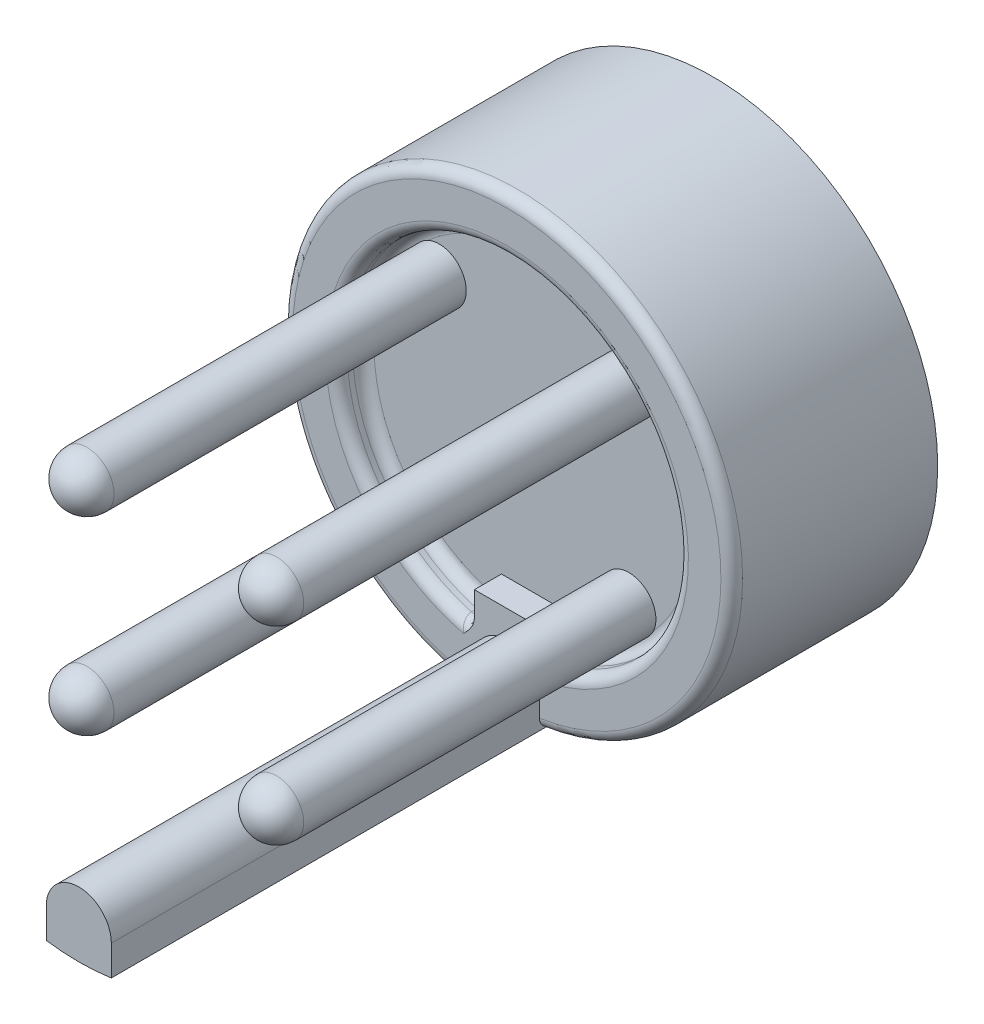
ISO-10303-21;
HEADER;
FILE_DESCRIPTION(('STEP AP214'),'2;1');
FILE_NAME('part.step','',(''),(''),'','','');
FILE_SCHEMA(('AUTOMOTIVE_DESIGN { 1 0 10303 214 1 1 1 1 }'));
ENDSEC;
DATA;
#1=APPLICATION_CONTEXT('core data for automotive mechanical design processes');
#2=APPLICATION_PROTOCOL_DEFINITION('international standard','automotive_design',2000,#1);
#3=PRODUCT_CONTEXT('',#1,'mechanical');
#4=PRODUCT('Part','Part','',(#3));
#5=PRODUCT_RELATED_PRODUCT_CATEGORY('part','',(#4));
#6=PRODUCT_DEFINITION_FORMATION('','',#4);
#7=PRODUCT_DEFINITION_CONTEXT('part definition',#1,'design');
#8=PRODUCT_DEFINITION('design','',#6,#7);
#9=PRODUCT_DEFINITION_SHAPE('','',#8);
#10=(LENGTH_UNIT() NAMED_UNIT(*) SI_UNIT(.MILLI.,.METRE.));
#11=(NAMED_UNIT(*) PLANE_ANGLE_UNIT() SI_UNIT($,.RADIAN.));
#12=(NAMED_UNIT(*) SI_UNIT($,.STERADIAN.) SOLID_ANGLE_UNIT());
#13=UNCERTAINTY_MEASURE_WITH_UNIT(LENGTH_MEASURE(1.E-05),#10,'distance_accuracy_value','');
#14=(GEOMETRIC_REPRESENTATION_CONTEXT(3) GLOBAL_UNCERTAINTY_ASSIGNED_CONTEXT((#13)) GLOBAL_UNIT_ASSIGNED_CONTEXT((#10,
#11,#12)) REPRESENTATION_CONTEXT('',''));
#15=CARTESIAN_POINT('',(0.,0.,0.));
#16=DIRECTION('',(0.,0.,1.));
#17=DIRECTION('',(1.,0.,0.));
#18=AXIS2_PLACEMENT_3D('',#15,#16,#17);
#19=CARTESIAN_POINT('',(1.75,1.75,46.6));
#20=DIRECTION('',(0.728805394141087,0.59115314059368,0.345515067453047));
#21=DIRECTION('',(-0.64541673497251,0.761598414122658,0.0583531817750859));
#22=AXIS2_PLACEMENT_3D('',#19,#20,#21);
#23=SPHERICAL_SURFACE('',#22,0.5);
#24=CARTESIAN_POINT('',(2.11440269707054,2.04557657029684,46.7727575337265));
#25=VERTEX_POINT('',#24);
#26=VERTEX_LOOP('',#25);
#27=FACE_BOUND('',#26,.T.);
#28=CARTESIAN_POINT('',(1.75,1.75,46.6));
#29=DIRECTION('',(0.,0.,1.));
#30=DIRECTION('',(1.,0.,0.));
#31=AXIS2_PLACEMENT_3D('',#28,#29,#30);
#32=CIRCLE('',#31,0.5);
#33=CARTESIAN_POINT('',(2.25,1.75,46.6));
#34=VERTEX_POINT('',#33);
#35=EDGE_CURVE('E23',#34,#34,#32,.F.);
#36=ORIENTED_EDGE('',*,*,#35,.F.);
#37=EDGE_LOOP('',(#36));
#38=FACE_BOUND('',#37,.T.);
#39=ADVANCED_FACE('F16',(#27,#38),#23,.T.);
#40=CARTESIAN_POINT('',(1.75,-1.75,46.6));
#41=DIRECTION('',(0.728805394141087,0.59115314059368,0.345515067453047));
#42=DIRECTION('',(-0.64541673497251,0.761598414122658,0.0583531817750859));
#43=AXIS2_PLACEMENT_3D('',#40,#41,#42);
#44=SPHERICAL_SURFACE('',#43,0.5);
#45=CARTESIAN_POINT('',(1.75,-1.75,46.6));
#46=DIRECTION('',(0.,0.,1.));
#47=DIRECTION('',(1.,0.,0.));
#48=AXIS2_PLACEMENT_3D('',#45,#46,#47);
#49=CIRCLE('',#48,0.5);
#50=CARTESIAN_POINT('',(2.25,-1.75,46.6));
#51=VERTEX_POINT('',#50);
#52=EDGE_CURVE('E707',#51,#51,#49,.F.);
#53=ORIENTED_EDGE('',*,*,#52,.F.);
#54=EDGE_LOOP('',(#53));
#55=FACE_BOUND('',#54,.T.);
#56=CARTESIAN_POINT('',(2.11440269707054,-1.45442342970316,46.7727575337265));
#57=VERTEX_POINT('',#56);
#58=VERTEX_LOOP('',#57);
#59=FACE_BOUND('',#58,.T.);
#60=ADVANCED_FACE('F629',(#55,#59),#44,.T.);
#61=CARTESIAN_POINT('',(-1.75,1.75,46.6));
#62=DIRECTION('',(0.728805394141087,0.59115314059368,0.345515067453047));
#63=DIRECTION('',(-0.64541673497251,0.761598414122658,0.0583531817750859));
#64=AXIS2_PLACEMENT_3D('',#61,#62,#63);
#65=SPHERICAL_SURFACE('',#64,0.5);
#66=CARTESIAN_POINT('',(-1.38559730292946,2.04557657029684,46.7727575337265));
#67=VERTEX_POINT('',#66);
#68=VERTEX_LOOP('',#67);
#69=FACE_BOUND('',#68,.T.);
#70=CARTESIAN_POINT('',(-1.75,1.75,46.6));
#71=DIRECTION('',(0.,0.,1.));
#72=DIRECTION('',(1.,0.,0.));
#73=AXIS2_PLACEMENT_3D('',#70,#71,#72);
#74=CIRCLE('',#73,0.5);
#75=CARTESIAN_POINT('',(-1.25,1.75,46.6));
#76=VERTEX_POINT('',#75);
#77=EDGE_CURVE('E700',#76,#76,#74,.F.);
#78=ORIENTED_EDGE('',*,*,#77,.F.);
#79=EDGE_LOOP('',(#78));
#80=FACE_BOUND('',#79,.T.);
#81=ADVANCED_FACE('F624',(#69,#80),#65,.T.);
#82=CARTESIAN_POINT('',(-1.75,-1.75,46.6));
#83=DIRECTION('',(0.728805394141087,0.59115314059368,0.345515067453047));
#84=DIRECTION('',(-0.64541673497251,0.761598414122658,0.0583531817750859));
#85=AXIS2_PLACEMENT_3D('',#82,#83,#84);
#86=SPHERICAL_SURFACE('',#85,0.5);
#87=CARTESIAN_POINT('',(-1.75,-1.75,46.6));
#88=DIRECTION('',(0.,0.,1.));
#89=DIRECTION('',(1.,0.,0.));
#90=AXIS2_PLACEMENT_3D('',#87,#88,#89);
#91=CIRCLE('',#90,0.5);
#92=CARTESIAN_POINT('',(-1.25,-1.75,46.6));
#93=VERTEX_POINT('',#92);
#94=EDGE_CURVE('E144',#93,#93,#91,.F.);
#95=ORIENTED_EDGE('',*,*,#94,.F.);
#96=EDGE_LOOP('',(#95));
#97=FACE_BOUND('',#96,.T.);
#98=CARTESIAN_POINT('',(-1.38559730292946,-1.45442342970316,46.7727575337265));
#99=VERTEX_POINT('',#98);
#100=VERTEX_LOOP('',#99);
#101=FACE_BOUND('',#100,.T.);
#102=ADVANCED_FACE('F620',(#97,#101),#86,.T.);
#103=CARTESIAN_POINT('',(1.75,1.75,43.6));
#104=DIRECTION('',(0.,0.,1.));
#105=DIRECTION('',(1.,0.,0.));
#106=AXIS2_PLACEMENT_3D('',#103,#104,#105);
#107=CYLINDRICAL_SURFACE('',#106,0.5);
#108=ORIENTED_EDGE('',*,*,#35,.T.);
#109=EDGE_LOOP('',(#108));
#110=FACE_BOUND('',#109,.T.);
#111=CARTESIAN_POINT('',(2.20268215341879,1.96231784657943,40.1));
#112=CARTESIAN_POINT('',(2.19663997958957,1.97519855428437,40.1000049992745));
#113=CARTESIAN_POINT('',(2.19005320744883,1.98781257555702,40.1001224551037));
#114=CARTESIAN_POINT('',(2.17583073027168,2.01243237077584,40.1004500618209));
#115=CARTESIAN_POINT('',(2.16819510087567,2.02443818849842,40.1006602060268));
#116=CARTESIAN_POINT('',(2.14424939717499,2.0587523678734,40.1012202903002));
#117=CARTESIAN_POINT('',(2.12654121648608,2.080117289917,40.1015155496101));
#118=CARTESIAN_POINT('',(2.09695769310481,2.11032834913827,40.1015682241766));
#119=CARTESIAN_POINT('',(2.0862430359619,2.12034552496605,40.1015129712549));
#120=CARTESIAN_POINT('',(2.06397154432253,2.13940509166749,40.1012872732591));
#121=CARTESIAN_POINT('',(2.05241458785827,2.1484473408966,40.1011168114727));
#122=CARTESIAN_POINT('',(2.02818238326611,2.16574389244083,40.1007218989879));
#123=CARTESIAN_POINT('',(2.01548359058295,2.17396513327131,40.1004959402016));
#124=CARTESIAN_POINT('',(1.98939389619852,2.18922587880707,40.100139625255));
#125=CARTESIAN_POINT('',(1.97600300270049,2.19626539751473,40.1000092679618));
#126=CARTESIAN_POINT('',(1.96231784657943,2.20268215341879,40.1));
#127=B_SPLINE_CURVE_WITH_KNOTS('',3,(#111,#112,#113,#114,#115,#116,#117,#118,#119,#120,#121,
#122,#123,#124,#125,#126),.UNSPECIFIED.,.F.,.F.,(4,2,2,2,2,2,2,4),(0.,0.0426496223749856,
0.085296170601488,0.168098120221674,0.212056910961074,0.256022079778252,0.301348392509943,
0.346674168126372),.UNSPECIFIED.);
#128=CARTESIAN_POINT('',(2.2026821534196,1.96231784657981,40.1));
#129=VERTEX_POINT('',#128);
#130=CARTESIAN_POINT('',(1.96231784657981,2.2026821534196,40.1));
#131=VERTEX_POINT('',#130);
#132=EDGE_CURVE('E126',#129,#131,#127,.T.);
#133=ORIENTED_EDGE('',*,*,#132,.T.);
#134=CARTESIAN_POINT('',(1.75,1.75,40.1));
#135=DIRECTION('',(0.,0.,1.));
#136=DIRECTION('',(1.,0.,0.));
#137=AXIS2_PLACEMENT_3D('',#134,#135,#136);
#138=CIRCLE('',#137,0.5);
#139=EDGE_CURVE('E139',#131,#129,#138,.T.);
#140=ORIENTED_EDGE('',*,*,#139,.T.);
#141=EDGE_LOOP('',(#133,#140));
#142=FACE_BOUND('',#141,.T.);
#143=ADVANCED_FACE('F140',(#110,#142),#107,.T.);
#144=CARTESIAN_POINT('',(1.75,-1.75,43.6));
#145=DIRECTION('',(0.,0.,1.));
#146=DIRECTION('',(1.,0.,0.));
#147=AXIS2_PLACEMENT_3D('',#144,#145,#146);
#148=CYLINDRICAL_SURFACE('',#147,0.5);
#149=CARTESIAN_POINT('',(1.96231784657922,-2.20268215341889,40.1));
#150=CARTESIAN_POINT('',(1.97519855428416,-2.19663997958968,40.1000049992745));
#151=CARTESIAN_POINT('',(1.98781257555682,-2.19005320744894,40.1001224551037));
#152=CARTESIAN_POINT('',(2.01243237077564,-2.1758307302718,40.1004500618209));
#153=CARTESIAN_POINT('',(2.02443818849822,-2.1681951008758,40.1006602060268));
#154=CARTESIAN_POINT('',(2.05875236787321,-2.14424939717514,40.1012202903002));
#155=CARTESIAN_POINT('',(2.08011728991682,-2.12654121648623,40.1015155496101));
#156=CARTESIAN_POINT('',(2.11032834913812,-2.09695769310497,40.1015682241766));
#157=CARTESIAN_POINT('',(2.12034552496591,-2.08624303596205,40.1015129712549));
#158=CARTESIAN_POINT('',(2.13940509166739,-2.06397154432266,40.1012872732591));
#159=CARTESIAN_POINT('',(2.14844734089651,-2.05241458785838,40.1011168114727));
#160=CARTESIAN_POINT('',(2.16574389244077,-2.0281823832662,40.1007218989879));
#161=CARTESIAN_POINT('',(2.17396513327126,-2.01548359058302,40.1004959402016));
#162=CARTESIAN_POINT('',(2.18922587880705,-1.98939389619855,40.100139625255));
#163=CARTESIAN_POINT('',(2.19626539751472,-1.97600300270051,40.1000092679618));
#164=CARTESIAN_POINT('',(2.20268215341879,-1.96231784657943,40.1));
#165=B_SPLINE_CURVE_WITH_KNOTS('',3,(#149,#150,#151,#152,#153,#154,#155,#156,#157,#158,#159,
#160,#161,#162,#163,#164),.UNSPECIFIED.,.F.,.F.,(4,2,2,2,2,2,2,4),(0.,0.0426496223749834,
0.085296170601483,0.168098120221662,0.212056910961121,0.256022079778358,0.301348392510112,
0.346674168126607),.UNSPECIFIED.);
#166=CARTESIAN_POINT('',(1.96231784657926,-2.20268215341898,40.1));
#167=VERTEX_POINT('',#166);
#168=CARTESIAN_POINT('',(2.2026821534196,-1.96231784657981,40.1));
#169=VERTEX_POINT('',#168);
#170=EDGE_CURVE('E137',#167,#169,#165,.T.);
#171=ORIENTED_EDGE('',*,*,#170,.T.);
#172=CARTESIAN_POINT('',(1.75,-1.75,40.1));
#173=DIRECTION('',(0.,0.,1.));
#174=DIRECTION('',(1.,0.,0.));
#175=AXIS2_PLACEMENT_3D('',#172,#173,#174);
#176=CIRCLE('',#175,0.5);
#177=EDGE_CURVE('E143',#169,#167,#176,.T.);
#178=ORIENTED_EDGE('',*,*,#177,.T.);
#179=EDGE_LOOP('',(#171,#178));
#180=FACE_BOUND('',#179,.T.);
#181=ORIENTED_EDGE('',*,*,#52,.T.);
#182=EDGE_LOOP('',(#181));
#183=FACE_BOUND('',#182,.T.);
#184=ADVANCED_FACE('F718',(#180,#183),#148,.T.);
#185=CARTESIAN_POINT('',(-1.75,1.75,43.6));
#186=DIRECTION('',(0.,0.,1.));
#187=DIRECTION('',(1.,0.,0.));
#188=AXIS2_PLACEMENT_3D('',#185,#186,#187);
#189=CYLINDRICAL_SURFACE('',#188,0.5);
#190=CARTESIAN_POINT('',(-1.96231784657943,2.20268215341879,40.1));
#191=CARTESIAN_POINT('',(-1.97519855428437,2.19663997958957,40.1000049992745));
#192=CARTESIAN_POINT('',(-1.98781257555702,2.19005320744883,40.1001224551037));
#193=CARTESIAN_POINT('',(-2.01243237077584,2.17583073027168,40.1004500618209));
#194=CARTESIAN_POINT('',(-2.02443818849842,2.16819510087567,40.1006602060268));
#195=CARTESIAN_POINT('',(-2.0587523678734,2.14424939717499,40.1012202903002));
#196=CARTESIAN_POINT('',(-2.080117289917,2.12654121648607,40.1015155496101));
#197=CARTESIAN_POINT('',(-2.11032834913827,2.0969576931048,40.1015682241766));
#198=CARTESIAN_POINT('',(-2.12034552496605,2.0862430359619,40.1015129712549));
#199=CARTESIAN_POINT('',(-2.1394050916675,2.06397154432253,40.1012872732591));
#200=CARTESIAN_POINT('',(-2.1484473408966,2.05241458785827,40.1011168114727));
#201=CARTESIAN_POINT('',(-2.16574389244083,2.02818238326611,40.1007218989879));
#202=CARTESIAN_POINT('',(-2.17396513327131,2.01548359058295,40.1004959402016));
#203=CARTESIAN_POINT('',(-2.18922587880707,1.98939389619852,40.100139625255));
#204=CARTESIAN_POINT('',(-2.19626539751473,1.97600300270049,40.1000092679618));
#205=CARTESIAN_POINT('',(-2.20268215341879,1.96231784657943,40.1));
#206=B_SPLINE_CURVE_WITH_KNOTS('',3,(#190,#191,#192,#193,#194,#195,#196,#197,#198,#199,#200,
#201,#202,#203,#204,#205),.UNSPECIFIED.,.F.,.F.,(4,2,2,2,2,2,2,4),(0.,0.0426496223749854,
0.085296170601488,0.168098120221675,0.212056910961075,0.256022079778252,0.301348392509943,
0.346674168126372),.UNSPECIFIED.);
#207=CARTESIAN_POINT('',(-1.96231784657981,2.2026821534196,40.1));
#208=VERTEX_POINT('',#207);
#209=CARTESIAN_POINT('',(-2.2026821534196,1.96231784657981,40.1));
#210=VERTEX_POINT('',#209);
#211=EDGE_CURVE('E704',#208,#210,#206,.T.);
#212=ORIENTED_EDGE('',*,*,#211,.T.);
#213=CARTESIAN_POINT('',(-1.75,1.75,40.1));
#214=DIRECTION('',(0.,0.,1.));
#215=DIRECTION('',(1.,0.,0.));
#216=AXIS2_PLACEMENT_3D('',#213,#214,#215);
#217=CIRCLE('',#216,0.5);
#218=EDGE_CURVE('E214',#210,#208,#217,.T.);
#219=ORIENTED_EDGE('',*,*,#218,.T.);
#220=EDGE_LOOP('',(#212,#219));
#221=FACE_BOUND('',#220,.T.);
#222=ORIENTED_EDGE('',*,*,#77,.T.);
#223=EDGE_LOOP('',(#222));
#224=FACE_BOUND('',#223,.T.);
#225=ADVANCED_FACE('F715',(#221,#224),#189,.T.);
#226=CARTESIAN_POINT('',(-1.75,-1.75,43.6));
#227=DIRECTION('',(0.,0.,1.));
#228=DIRECTION('',(1.,0.,0.));
#229=AXIS2_PLACEMENT_3D('',#226,#227,#228);
#230=CYLINDRICAL_SURFACE('',#229,0.5);
#231=ORIENTED_EDGE('',*,*,#94,.T.);
#232=EDGE_LOOP('',(#231));
#233=FACE_BOUND('',#232,.T.);
#234=CARTESIAN_POINT('',(-2.20268215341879,-1.96231784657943,40.1));
#235=CARTESIAN_POINT('',(-2.19663997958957,-1.97519855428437,40.1000049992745));
#236=CARTESIAN_POINT('',(-2.19005320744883,-1.98781257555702,40.1001224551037));
#237=CARTESIAN_POINT('',(-2.17583073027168,-2.01243237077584,40.1004500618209));
#238=CARTESIAN_POINT('',(-2.16819510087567,-2.02443818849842,40.1006602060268));
#239=CARTESIAN_POINT('',(-2.14424939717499,-2.0587523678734,40.1012202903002));
#240=CARTESIAN_POINT('',(-2.12654121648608,-2.080117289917,40.1015155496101));
#241=CARTESIAN_POINT('',(-2.09695769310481,-2.11032834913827,40.1015682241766));
#242=CARTESIAN_POINT('',(-2.0862430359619,-2.12034552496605,40.1015129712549));
#243=CARTESIAN_POINT('',(-2.06397154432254,-2.13940509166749,40.1012872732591));
#244=CARTESIAN_POINT('',(-2.05241458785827,-2.1484473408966,40.1011168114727));
#245=CARTESIAN_POINT('',(-2.02818238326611,-2.16574389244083,40.1007218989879));
#246=CARTESIAN_POINT('',(-2.01548359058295,-2.17396513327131,40.1004959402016));
#247=CARTESIAN_POINT('',(-1.98939389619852,-2.18922587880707,40.100139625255));
#248=CARTESIAN_POINT('',(-1.97600300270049,-2.19626539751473,40.1000092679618));
#249=CARTESIAN_POINT('',(-1.96231784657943,-2.20268215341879,40.1));
#250=B_SPLINE_CURVE_WITH_KNOTS('',3,(#234,#235,#236,#237,#238,#239,#240,#241,#242,#243,#244,
#245,#246,#247,#248,#249),.UNSPECIFIED.,.F.,.F.,(4,2,2,2,2,2,2,4),(0.,0.0426496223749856,
0.0852961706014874,0.168098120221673,0.212056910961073,0.256022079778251,0.301348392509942,
0.346674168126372),.UNSPECIFIED.);
#251=CARTESIAN_POINT('',(-2.2026821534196,-1.96231784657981,40.1));
#252=VERTEX_POINT('',#251);
#253=CARTESIAN_POINT('',(-1.96231784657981,-2.2026821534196,40.1));
#254=VERTEX_POINT('',#253);
#255=EDGE_CURVE('E592',#252,#254,#250,.T.);
#256=ORIENTED_EDGE('',*,*,#255,.T.);
#257=CARTESIAN_POINT('',(-1.75,-1.75,40.1));
#258=DIRECTION('',(0.,0.,1.));
#259=DIRECTION('',(1.,0.,0.));
#260=AXIS2_PLACEMENT_3D('',#257,#258,#259);
#261=CIRCLE('',#260,0.5);
#262=EDGE_CURVE('E584',#254,#252,#261,.T.);
#263=ORIENTED_EDGE('',*,*,#262,.T.);
#264=EDGE_LOOP('',(#256,#263));
#265=FACE_BOUND('',#264,.T.);
#266=ADVANCED_FACE('F172',(#233,#265),#230,.T.);
#267=CARTESIAN_POINT('',(0.,0.,40.1));
#268=DIRECTION('',(0.,0.,-1.));
#269=DIRECTION('',(-1.,0.,0.));
#270=AXIS2_PLACEMENT_3D('',#267,#268,#269);
#271=PLANE('',#270);
#272=ORIENTED_EDGE('',*,*,#218,.F.);
#273=CARTESIAN_POINT('',(0.,0.,40.1));
#274=DIRECTION('',(0.,0.,-1.));
#275=DIRECTION('',(-0.746671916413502,-0.66519249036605,0.));
#276=AXIS2_PLACEMENT_3D('',#273,#274,#275);
#277=CIRCLE('',#276,2.95000000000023);
#278=EDGE_CURVE('E204',#210,#252,#277,.F.);
#279=ORIENTED_EDGE('',*,*,#278,.T.);
#280=ORIENTED_EDGE('',*,*,#262,.F.);
#281=CARTESIAN_POINT('',(0.,0.,40.1));
#282=DIRECTION('',(0.,0.,-1.));
#283=DIRECTION('',(-0.205344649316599,-0.978689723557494,0.));
#284=AXIS2_PLACEMENT_3D('',#281,#282,#283);
#285=CIRCLE('',#284,2.95000000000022);
#286=CARTESIAN_POINT('',(-0.605766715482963,-2.88713468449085,40.1));
#287=VERTEX_POINT('',#286);
#288=EDGE_CURVE('E587',#254,#287,#285,.F.);
#289=ORIENTED_EDGE('',*,*,#288,.T.);
#290=CARTESIAN_POINT('',(-0.8,-2.8394541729,40.1));
#291=DIRECTION('',(0.,0.,-1.));
#292=DIRECTION('',(-1.,0.,0.));
#293=AXIS2_PLACEMENT_3D('',#290,#291,#292);
#294=CIRCLE('',#293,0.2);
#295=CARTESIAN_POINT('',(-0.6,-2.8394541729,40.1));
#296=VERTEX_POINT('',#295);
#297=EDGE_CURVE('E590',#296,#287,#294,.T.);
#298=ORIENTED_EDGE('',*,*,#297,.F.);
#299=DIRECTION('',(0.,1.,0.));
#300=VECTOR('',#299,1.);
#301=CARTESIAN_POINT('',(-0.6,0.,40.1));
#302=LINE('',#301,#300);
#303=CARTESIAN_POINT('',(-0.6,-2.45,40.1));
#304=VERTEX_POINT('',#303);
#305=EDGE_CURVE('E75',#304,#296,#302,.F.);
#306=ORIENTED_EDGE('',*,*,#305,.F.);
#307=DIRECTION('',(-1.,0.,0.));
#308=VECTOR('',#307,1.);
#309=CARTESIAN_POINT('',(0.,-2.45,40.1));
#310=LINE('',#309,#308);
#311=CARTESIAN_POINT('',(0.6,-2.45,40.1));
#312=VERTEX_POINT('',#311);
#313=EDGE_CURVE('E87',#312,#304,#310,.T.);
#314=ORIENTED_EDGE('',*,*,#313,.F.);
#315=DIRECTION('',(0.,1.,0.));
#316=VECTOR('',#315,1.);
#317=CARTESIAN_POINT('',(0.6,0.,40.1));
#318=LINE('',#317,#316);
#319=CARTESIAN_POINT('',(0.6,-2.8394541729,40.1));
#320=VERTEX_POINT('',#319);
#321=EDGE_CURVE('E612',#320,#312,#318,.T.);
#322=ORIENTED_EDGE('',*,*,#321,.F.);
#323=CARTESIAN_POINT('',(0.8,-2.8394541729,40.1));
#324=DIRECTION('',(0.,0.,1.));
#325=DIRECTION('',(1.,0.,0.));
#326=AXIS2_PLACEMENT_3D('',#323,#324,#325);
#327=CIRCLE('',#326,0.2);
#328=CARTESIAN_POINT('',(0.605766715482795,-2.88713468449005,40.1));
#329=VERTEX_POINT('',#328);
#330=EDGE_CURVE('E686',#329,#320,#327,.F.);
#331=ORIENTED_EDGE('',*,*,#330,.F.);
#332=CARTESIAN_POINT('',(0.,0.,40.1));
#333=DIRECTION('',(0.,0.,-1.));
#334=DIRECTION('',(0.665192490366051,-0.746671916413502,0.));
#335=AXIS2_PLACEMENT_3D('',#332,#333,#334);
#336=CIRCLE('',#335,2.94999999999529);
#337=EDGE_CURVE('E152',#329,#167,#336,.F.);
#338=ORIENTED_EDGE('',*,*,#337,.T.);
#339=ORIENTED_EDGE('',*,*,#177,.F.);
#340=CARTESIAN_POINT('',(0.,0.,40.1));
#341=DIRECTION('',(0.,0.,-1.));
#342=DIRECTION('',(0.746671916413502,0.665192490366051,0.));
#343=AXIS2_PLACEMENT_3D('',#340,#341,#342);
#344=CIRCLE('',#343,2.95000000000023);
#345=EDGE_CURVE('E130',#169,#129,#344,.F.);
#346=ORIENTED_EDGE('',*,*,#345,.T.);
#347=ORIENTED_EDGE('',*,*,#139,.F.);
#348=CARTESIAN_POINT('',(0.,0.,40.1));
#349=DIRECTION('',(0.,0.,-1.));
#350=DIRECTION('',(-0.66519249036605,0.746671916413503,0.));
#351=AXIS2_PLACEMENT_3D('',#348,#349,#350);
#352=CIRCLE('',#351,2.95000000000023);
#353=EDGE_CURVE('E133',#131,#208,#352,.F.);
#354=ORIENTED_EDGE('',*,*,#353,.T.);
#355=EDGE_LOOP('',(#272,#279,#280,#289,#298,#306,#314,#322,#331,#338,#339,#346,#347,#354));
#356=FACE_BOUND('',#355,.T.);
#357=ADVANCED_FACE('F147',(#356),#271,.F.);
#358=CARTESIAN_POINT('',(0.,0.,40.3));
#359=DIRECTION('',(0.,0.,-1.));
#360=DIRECTION('',(0.,-1.,0.));
#361=AXIS2_PLACEMENT_3D('',#358,#359,#360);
#362=TOROIDAL_SURFACE('',#361,2.95,0.2);
#363=ORIENTED_EDGE('',*,*,#211,.F.);
#364=ORIENTED_EDGE('',*,*,#353,.F.);
#365=ORIENTED_EDGE('',*,*,#132,.F.);
#366=ORIENTED_EDGE('',*,*,#345,.F.);
#367=ORIENTED_EDGE('',*,*,#170,.F.);
#368=ORIENTED_EDGE('',*,*,#337,.F.);
#369=CARTESIAN_POINT('',(0.605766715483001,-2.88713468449,40.1));
#370=CARTESIAN_POINT('',(0.606164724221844,-2.8887546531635,40.0999999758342));
#371=CARTESIAN_POINT('',(0.606584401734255,-2.89036927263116,40.1000208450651));
#372=CARTESIAN_POINT('',(0.607468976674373,-2.89359715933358,40.1001043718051));
#373=CARTESIAN_POINT('',(0.607934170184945,-2.89521033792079,40.100167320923));
#374=CARTESIAN_POINT('',(0.608909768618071,-2.89843422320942,40.100335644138));
#375=CARTESIAN_POINT('',(0.609420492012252,-2.90004481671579,40.1004413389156));
#376=CARTESIAN_POINT('',(0.610487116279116,-2.90326240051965,40.1006957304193));
#377=CARTESIAN_POINT('',(0.61104335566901,-2.90486925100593,40.1008447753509));
#378=CARTESIAN_POINT('',(0.612200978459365,-2.90807817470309,40.1011864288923));
#379=CARTESIAN_POINT('',(0.612802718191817,-2.90968007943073,40.1013794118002));
#380=CARTESIAN_POINT('',(0.614051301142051,-2.91287790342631,40.1018094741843));
#381=CARTESIAN_POINT('',(0.614698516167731,-2.91447362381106,40.1020469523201));
#382=CARTESIAN_POINT('',(0.616038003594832,-2.91765783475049,40.1025665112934));
#383=CARTESIAN_POINT('',(0.616730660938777,-2.91924609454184,40.1028490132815));
#384=CARTESIAN_POINT('',(0.618160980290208,-2.92241410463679,40.1034590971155));
#385=CARTESIAN_POINT('',(0.61889903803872,-2.92399359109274,40.1037871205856));
#386=CARTESIAN_POINT('',(0.620420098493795,-2.92714273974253,40.1044886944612));
#387=CARTESIAN_POINT('',(0.62120350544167,-2.92871210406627,40.1048627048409));
#388=CARTESIAN_POINT('',(0.622815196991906,-2.9318396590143,40.1056566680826));
#389=CARTESIAN_POINT('',(0.623643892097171,-2.93339751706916,40.1060770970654));
#390=CARTESIAN_POINT('',(0.625346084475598,-2.93650067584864,40.1069642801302));
#391=CARTESIAN_POINT('',(0.626219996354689,-2.93804560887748,40.1074315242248));
#392=CARTESIAN_POINT('',(0.628012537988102,-2.94112150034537,40.1084126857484));
#393=CARTESIAN_POINT('',(0.628931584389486,-2.94265205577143,40.1089271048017));
#394=CARTESIAN_POINT('',(0.630814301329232,-2.9456977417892,40.1100029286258));
#395=CARTESIAN_POINT('',(0.631778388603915,-2.94721243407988,40.1105648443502));
#396=CARTESIAN_POINT('',(0.6337510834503,-2.95022491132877,40.1117359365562));
#397=CARTESIAN_POINT('',(0.634760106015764,-2.95172222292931,40.1123456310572));
#398=CARTESIAN_POINT('',(0.636822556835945,-2.95469842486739,40.1136125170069));
#399=CARTESIAN_POINT('',(0.637876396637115,-2.9561768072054,40.1142702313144));
#400=CARTESIAN_POINT('',(0.64002835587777,-2.95911360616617,40.1156333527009));
#401=CARTESIAN_POINT('',(0.6411268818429,-2.9605714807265,40.1163392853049));
#402=CARTESIAN_POINT('',(0.643368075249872,-2.96346569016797,40.1177989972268));
#403=CARTESIAN_POINT('',(0.644511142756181,-2.96490144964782,40.1185533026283));
#404=CARTESIAN_POINT('',(0.646841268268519,-2.96774982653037,40.1201098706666));
#405=CARTESIAN_POINT('',(0.648028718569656,-2.96916183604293,40.1209126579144));
#406=CARTESIAN_POINT('',(0.650447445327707,-2.97196108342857,40.12256625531));
#407=CARTESIAN_POINT('',(0.651679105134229,-2.97334768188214,40.1234175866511));
#408=CARTESIAN_POINT('',(0.654186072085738,-2.97609445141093,40.1251682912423));
#409=CARTESIAN_POINT('',(0.655461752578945,-2.9774539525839,40.1260681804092));
#410=CARTESIAN_POINT('',(0.658056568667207,-2.98014484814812,40.1279159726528));
#411=CARTESIAN_POINT('',(0.659376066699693,-2.98147554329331,40.1288643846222));
#412=CARTESIAN_POINT('',(0.662058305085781,-2.98410712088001,40.1308091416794));
#413=CARTESIAN_POINT('',(0.663421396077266,-2.98540727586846,40.1318059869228));
#414=CARTESIAN_POINT('',(0.666190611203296,-2.98797605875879,40.1338474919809));
#415=CARTESIAN_POINT('',(0.667597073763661,-2.98924393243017,40.1348926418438));
#416=CARTESIAN_POINT('',(0.670452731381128,-2.99174636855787,40.1370305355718));
#417=CARTESIAN_POINT('',(0.671902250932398,-2.99298015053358,40.1381237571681));
#418=CARTESIAN_POINT('',(0.676347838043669,-2.9966563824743,40.1414997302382));
#419=CARTESIAN_POINT('',(0.679376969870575,-2.99901441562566,40.1438315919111));
#420=CARTESIAN_POINT('',(0.685601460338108,-3.0035792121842,40.148680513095));
#421=CARTESIAN_POINT('',(0.688799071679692,-3.00577917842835,40.1512010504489));
#422=CARTESIAN_POINT('',(0.695359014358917,-3.01001308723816,40.1564236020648));
#423=CARTESIAN_POINT('',(0.698723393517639,-3.01203990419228,40.1591288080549));
#424=CARTESIAN_POINT('',(0.705611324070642,-3.01591557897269,40.1647186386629));
#425=CARTESIAN_POINT('',(0.70913659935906,-3.01775711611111,40.1676062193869));
#426=CARTESIAN_POINT('',(0.714582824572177,-3.0203835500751,40.1720890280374));
#427=CARTESIAN_POINT('',(0.716482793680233,-3.02125973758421,40.173656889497));
#428=CARTESIAN_POINT('',(0.720437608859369,-3.02300127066,40.1769254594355));
#429=CARTESIAN_POINT('',(0.722493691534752,-3.02386121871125,40.1786275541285));
#430=CARTESIAN_POINT('',(0.72675744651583,-3.02556039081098,40.1821708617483));
#431=CARTESIAN_POINT('',(0.728965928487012,-3.02639423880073,40.1840136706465));
#432=CARTESIAN_POINT('',(0.733532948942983,-3.02802873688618,40.1878430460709));
#433=CARTESIAN_POINT('',(0.735892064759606,-3.02882386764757,40.1898312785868));
#434=CARTESIAN_POINT('',(0.740757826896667,-3.03036801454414,40.1939561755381));
#435=CARTESIAN_POINT('',(0.74326480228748,-3.03111137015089,40.1960945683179));
#436=CARTESIAN_POINT('',(0.748423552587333,-3.03253794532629,40.2005238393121));
#437=CARTESIAN_POINT('',(0.751075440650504,-3.03321532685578,40.2028164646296));
#438=CARTESIAN_POINT('',(0.756520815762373,-3.03449501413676,40.2075576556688));
#439=CARTESIAN_POINT('',(0.759314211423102,-3.03509128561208,40.2100079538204));
#440=CARTESIAN_POINT('',(0.765038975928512,-3.03619284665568,40.2150671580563));
#441=CARTESIAN_POINT('',(0.76797006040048,-3.03669188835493,40.2176777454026));
#442=CARTESIAN_POINT('',(0.77396610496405,-3.0375821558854,40.223059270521));
#443=CARTESIAN_POINT('',(0.777030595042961,-3.03796690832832,40.2258318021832));
#444=CARTESIAN_POINT('',(0.783288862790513,-3.03861086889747,40.2315378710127));
#445=CARTESIAN_POINT('',(0.786481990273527,-3.03886337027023,40.2344728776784));
#446=CARTESIAN_POINT('',(0.792992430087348,-3.03922426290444,40.2405033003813));
#447=CARTESIAN_POINT('',(0.796308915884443,-3.03932571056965,40.2436000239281));
#448=CARTESIAN_POINT('',(0.803060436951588,-3.039365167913,40.2499518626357));
#449=CARTESIAN_POINT('',(0.80649447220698,-3.03929599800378,40.2532080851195));
#450=CARTESIAN_POINT('',(0.813474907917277,-3.03897422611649,40.2598753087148));
#451=CARTESIAN_POINT('',(0.81702013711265,-3.03871421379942,40.2632871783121));
#452=CARTESIAN_POINT('',(0.824216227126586,-3.03799022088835,40.2702603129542));
#453=CARTESIAN_POINT('',(0.827865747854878,-3.03751860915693,40.2738221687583));
#454=CARTESIAN_POINT('',(0.835263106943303,-3.03635046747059,40.2810879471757));
#455=CARTESIAN_POINT('',(0.839009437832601,-3.03564609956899,40.2847921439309));
#456=CARTESIAN_POINT('',(0.846592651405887,-3.03399131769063,40.2923331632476));
#457=CARTESIAN_POINT('',(0.850427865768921,-3.03303288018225,40.2961699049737));
#458=CARTESIAN_POINT('',(0.854237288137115,-3.03195954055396,40.3));
#459=B_SPLINE_CURVE_WITH_KNOTS('',3,(#369,#370,#371,#372,#373,#374,#375,#376,#377,#378,#379,
#380,#381,#382,#383,#384,#385,#386,#387,#388,#389,#390,#391,#392,#393,#394,#395,#396,#397,#398,
#399,#400,#401,#402,#403,#404,#405,#406,#407,#408,#409,#410,#411,#412,#413,#414,#415,#416,#417,
#418,#419,#420,#421,#422,#423,#424,#425,#426,#427,#428,#429,#430,#431,#432,#433,#434,#435,#436,
#437,#438,#439,#440,#441,#442,#443,#444,#445,#446,#447,#448,#449,#450,#451,#452,#453,#454,#455,
#456,#457,#458),.UNSPECIFIED.,.F.,.F.,(4,2,2,2,2,2,2,2,2,2,2,2,2,2,2,2,2,2,2,2,2,2,2,2,2,2,2,2,
2,2,2,2,2,2,2,2,2,2,2,2,2,2,2,2,4),(0.,0.00500412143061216,0.010043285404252,0.0151209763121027,
0.0202406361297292,0.0254056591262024,0.0306193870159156,0.0358851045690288,0.0412060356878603,
0.0465853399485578,0.0520261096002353,0.0575313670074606,0.0631040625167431,0.0687470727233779,
0.0744631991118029,0.0802551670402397,0.0861256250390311,0.0920771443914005,0.0981122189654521,
0.104233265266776,0.110442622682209,0.116742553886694,0.123135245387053,0.129622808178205,
0.136207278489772,0.1496732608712,0.163549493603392,0.177849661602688,0.192586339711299,
0.200428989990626,0.208840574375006,0.217823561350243,0.227380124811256,0.237512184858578,
0.24822143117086,0.259509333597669,0.271377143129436,0.283825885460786,0.29685634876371,
0.310469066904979,0.324664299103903,0.339442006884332,0.35480182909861,0.370743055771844,
0.387264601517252),.UNSPECIFIED.);
#460=CARTESIAN_POINT('',(0.854237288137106,-3.03195954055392,40.3));
#461=VERTEX_POINT('',#460);
#462=EDGE_CURVE('E220',#329,#461,#459,.T.);
#463=ORIENTED_EDGE('',*,*,#462,.T.);
#464=CARTESIAN_POINT('',(0.,0.,40.3));
#465=DIRECTION('',(0.,0.,-1.));
#466=DIRECTION('',(-1.,0.,0.));
#467=AXIS2_PLACEMENT_3D('',#464,#465,#466);
#468=CIRCLE('',#467,3.15);
#469=CARTESIAN_POINT('',(-0.854237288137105,-3.03195954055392,40.3));
#470=VERTEX_POINT('',#469);
#471=EDGE_CURVE('E239',#461,#470,#468,.F.);
#472=ORIENTED_EDGE('',*,*,#471,.T.);
#473=CARTESIAN_POINT('',(-0.854237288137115,-3.03195954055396,40.3));
#474=CARTESIAN_POINT('',(-0.850427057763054,-3.03303310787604,40.2961690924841));
#475=CARTESIAN_POINT('',(-0.846591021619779,-3.03399172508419,40.292331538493));
#476=CARTESIAN_POINT('',(-0.839006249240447,-3.03564674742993,40.284789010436));
#477=CARTESIAN_POINT('',(-0.835259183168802,-3.03635118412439,40.2810841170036));
#478=CARTESIAN_POINT('',(-0.827860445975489,-3.03751936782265,40.2738170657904));
#479=CARTESIAN_POINT('',(-0.824210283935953,-3.03799096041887,40.2702546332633));
#480=CARTESIAN_POINT('',(-0.817013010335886,-3.03871484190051,40.2632804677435));
#481=CARTESIAN_POINT('',(-0.813467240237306,-3.03897476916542,40.2598681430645));
#482=CARTESIAN_POINT('',(-0.806485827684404,-3.03929631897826,40.2532001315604));
#483=CARTESIAN_POINT('',(-0.803051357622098,-3.03936535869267,40.2499435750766));
#484=CARTESIAN_POINT('',(-0.796299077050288,-3.03932560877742,40.243591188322));
#485=CARTESIAN_POINT('',(-0.79298226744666,-3.03922400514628,40.2404942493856));
#486=CARTESIAN_POINT('',(-0.786471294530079,-3.03886278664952,40.2344635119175));
#487=CARTESIAN_POINT('',(-0.783277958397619,-3.03861012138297,40.2315284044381));
#488=CARTESIAN_POINT('',(-0.777019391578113,-3.03796583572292,40.2258222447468));
#489=CARTESIAN_POINT('',(-0.77395481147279,-3.03758092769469,40.2230497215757));
#490=CARTESIAN_POINT('',(-0.767958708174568,-3.03669036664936,40.2176683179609));
#491=CARTESIAN_POINT('',(-0.765027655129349,-3.03619119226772,40.2150578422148));
#492=CARTESIAN_POINT('',(-0.759303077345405,-3.03508939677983,40.2099989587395));
#493=CARTESIAN_POINT('',(-0.756509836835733,-3.03449302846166,40.207548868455));
#494=CARTESIAN_POINT('',(-0.751064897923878,-3.03321319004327,40.2028081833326));
#495=CARTESIAN_POINT('',(-0.748413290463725,-3.03253575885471,40.2005158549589));
#496=CARTESIAN_POINT('',(-0.743255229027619,-3.03110913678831,40.1960872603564));
#497=CARTESIAN_POINT('',(-0.740748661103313,-3.0303657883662,40.1939492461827));
#498=CARTESIAN_POINT('',(-0.735883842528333,-3.02882171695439,40.1898251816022));
#499=CARTESIAN_POINT('',(-0.733525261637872,-3.02802665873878,40.1878374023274));
#500=CARTESIAN_POINT('',(-0.7289594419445,-3.02639237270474,40.1840090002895));
#501=CARTESIAN_POINT('',(-0.726751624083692,-3.02555866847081,40.1821667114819));
#502=CARTESIAN_POINT('',(-0.722489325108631,-3.02385985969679,40.1786245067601));
#503=CARTESIAN_POINT('',(-0.720434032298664,-3.02300013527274,40.1769229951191));
#504=CARTESIAN_POINT('',(-0.716480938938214,-3.02125911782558,40.1736556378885));
#505=CARTESIAN_POINT('',(-0.714581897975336,-3.02038322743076,40.1720884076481));
#506=CARTESIAN_POINT('',(-0.709136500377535,-3.01775683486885,40.167605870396));
#507=CARTESIAN_POINT('',(-0.705611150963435,-3.01591497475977,40.1647179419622));
#508=CARTESIAN_POINT('',(-0.69872305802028,-3.01203867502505,40.1591275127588));
#509=CARTESIAN_POINT('',(-0.695358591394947,-3.01001155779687,40.1564220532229));
#510=CARTESIAN_POINT('',(-0.688798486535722,-3.00577705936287,40.1511990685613));
#511=CARTESIAN_POINT('',(-0.685600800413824,-3.0035768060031,40.1486783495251));
#512=CARTESIAN_POINT('',(-0.679376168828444,-2.99901146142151,40.143829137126));
#513=CARTESIAN_POINT('',(-0.67634697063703,-2.99665316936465,40.1414971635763));
#514=CARTESIAN_POINT('',(-0.671901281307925,-2.99297656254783,40.1381210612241));
#515=CARTESIAN_POINT('',(-0.670451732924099,-2.99174266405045,40.1370278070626));
#516=CARTESIAN_POINT('',(-0.667596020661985,-2.98924000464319,40.1348898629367));
#517=CARTESIAN_POINT('',(-0.666189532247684,-2.98797202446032,40.1338446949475));
#518=CARTESIAN_POINT('',(-0.663420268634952,-2.98540303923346,40.1318031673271));
#519=CARTESIAN_POINT('',(-0.662057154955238,-2.98410278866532,40.130806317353));
#520=CARTESIAN_POINT('',(-0.659374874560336,-2.98147103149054,40.1288615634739));
#521=CARTESIAN_POINT('',(-0.658055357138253,-2.98014025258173,40.1279131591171));
#522=CARTESIAN_POINT('',(-0.655460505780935,-2.97744920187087,40.1260653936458));
#523=CARTESIAN_POINT('',(-0.654184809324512,-2.97608962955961,40.1251655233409));
#524=CARTESIAN_POINT('',(-0.651677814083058,-2.97334273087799,40.1234148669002));
#525=CARTESIAN_POINT('',(-0.65044614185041,-2.97195607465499,40.1225635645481));
#526=CARTESIAN_POINT('',(-0.648027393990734,-2.96915672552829,40.1209100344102));
#527=CARTESIAN_POINT('',(-0.646839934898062,-2.96774467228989,40.1201072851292));
#528=CARTESIAN_POINT('',(-0.644509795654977,-2.96489622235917,40.1185508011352));
#529=CARTESIAN_POINT('',(-0.643366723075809,-2.96346043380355,40.1177965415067));
#530=CARTESIAN_POINT('',(-0.641125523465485,-2.96056618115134,40.1163369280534));
#531=CARTESIAN_POINT('',(-0.640026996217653,-2.95910829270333,40.1156310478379));
#532=CARTESIAN_POINT('',(-0.637875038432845,-2.95617148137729,40.1142680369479));
#533=CARTESIAN_POINT('',(-0.636821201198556,-2.95469310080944,40.113610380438));
#534=CARTESIAN_POINT('',(-0.634758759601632,-2.95171691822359,40.1123436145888));
#535=CARTESIAN_POINT('',(-0.633749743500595,-2.9502196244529,40.1117339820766));
#536=CARTESIAN_POINT('',(-0.631777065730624,-2.94720719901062,40.1105630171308));
#537=CARTESIAN_POINT('',(-0.630812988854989,-2.94569254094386,40.1100011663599));
#538=CARTESIAN_POINT('',(-0.628930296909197,-2.94264693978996,40.1089254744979));
#539=CARTESIAN_POINT('',(-0.628011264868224,-2.94111643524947,40.108411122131));
#540=CARTESIAN_POINT('',(-0.62621875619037,-2.938040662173,40.1074300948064));
#541=CARTESIAN_POINT('',(-0.625344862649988,-2.93649579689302,40.1069629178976));
#542=CARTESIAN_POINT('',(-0.6236427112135,-2.93339279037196,40.1060758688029));
#543=CARTESIAN_POINT('',(-0.622814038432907,-2.93183501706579,40.1056555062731));
#544=CARTESIAN_POINT('',(-0.621202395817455,-2.9287076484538,40.1048616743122));
#545=CARTESIAN_POINT('',(-0.620419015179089,-2.92713838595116,40.1044877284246));
#546=CARTESIAN_POINT('',(-0.618898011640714,-2.92398945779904,40.1037862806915));
#547=CARTESIAN_POINT('',(-0.618159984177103,-2.92241009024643,40.1034583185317));
#548=CARTESIAN_POINT('',(-0.616729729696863,-2.91924233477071,40.1028483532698));
#549=CARTESIAN_POINT('',(-0.616037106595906,-2.91765421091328,40.1025659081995));
#550=CARTESIAN_POINT('',(-0.614697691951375,-2.91447028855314,40.1020464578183));
#551=CARTESIAN_POINT('',(-0.614050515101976,-2.91287472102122,40.1018090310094));
#552=CARTESIAN_POINT('',(-0.612802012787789,-2.90967721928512,40.1013790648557));
#553=CARTESIAN_POINT('',(-0.612200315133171,-2.90807548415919,40.101186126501));
#554=CARTESIAN_POINT('',(-0.611042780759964,-2.90486691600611,40.1008445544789));
#555=CARTESIAN_POINT('',(-0.610486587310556,-2.90326025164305,40.1006955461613));
#556=CARTESIAN_POINT('',(-0.609420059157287,-2.90004305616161,40.1004412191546));
#557=CARTESIAN_POINT('',(-0.608909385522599,-2.89843266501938,40.100335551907));
#558=CARTESIAN_POINT('',(-0.60793389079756,-2.8952092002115,40.1001672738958));
#559=CARTESIAN_POINT('',(-0.607468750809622,-2.89359623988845,40.1001043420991));
#560=CARTESIAN_POINT('',(-0.606584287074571,-2.89036880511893,40.1000208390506));
#561=CARTESIAN_POINT('',(-0.606164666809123,-2.88875441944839,40.0999999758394));
#562=CARTESIAN_POINT('',(-0.605766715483,-2.88713468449,40.1));
#563=B_SPLINE_CURVE_WITH_KNOTS('',3,(#473,#474,#475,#476,#477,#478,#479,#480,#481,#482,#483,
#484,#485,#486,#487,#488,#489,#490,#491,#492,#493,#494,#495,#496,#497,#498,#499,#500,#501,#502,
#503,#504,#505,#506,#507,#508,#509,#510,#511,#512,#513,#514,#515,#516,#517,#518,#519,#520,#521,
#522,#523,#524,#525,#526,#527,#528,#529,#530,#531,#532,#533,#534,#535,#536,#537,#538,#539,#540,
#541,#542,#543,#544,#545,#546,#547,#548,#549,#550,#551,#552,#553,#554,#555,#556,#557,#558,#559,
#560,#561,#562),.UNSPECIFIED.,.F.,.F.,(4,2,2,2,2,2,2,2,2,2,2,2,2,2,2,2,2,2,2,2,2,2,2,2,2,2,2,2,
2,2,2,2,2,2,2,2,2,2,2,2,2,2,2,2,4),(0.,0.0165250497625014,0.0324693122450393,0.0478317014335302,
0.0626115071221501,0.0768083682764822,0.0904222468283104,0.103453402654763,0.11590237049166,
0.127769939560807,0.139057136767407,0.149765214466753,0.159895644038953,0.169450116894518,
0.178430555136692,0.186839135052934,0.19467832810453,0.209416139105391,0.22371730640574,
0.2375943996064,0.251061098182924,0.257645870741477,0.264133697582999,0.270526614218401,
0.276826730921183,0.283036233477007,0.289157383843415,0.295192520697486,0.301144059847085,
0.307014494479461,0.312806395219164,0.318522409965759,0.324165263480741,0.329737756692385,
0.33524276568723,0.340683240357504,0.346062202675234,0.351382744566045,0.356648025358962,
0.361861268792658,0.367025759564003,0.372144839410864,0.377221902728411,0.382260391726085,
0.387263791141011),.UNSPECIFIED.);
#564=EDGE_CURVE('E224',#470,#287,#563,.T.);
#565=ORIENTED_EDGE('',*,*,#564,.T.);
#566=ORIENTED_EDGE('',*,*,#288,.F.);
#567=ORIENTED_EDGE('',*,*,#255,.F.);
#568=ORIENTED_EDGE('',*,*,#278,.F.);
#569=EDGE_LOOP('',(#363,#364,#365,#366,#367,#368,#463,#472,#565,#566,#567,#568));
#570=FACE_BOUND('',#569,.T.);
#571=ADVANCED_FACE('F128',(#570),#362,.F.);
#572=CARTESIAN_POINT('',(0.8,-2.8394541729,40.3511827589));
#573=DIRECTION('',(0.,0.,1.));
#574=DIRECTION('',(1.,0.,0.));
#575=AXIS2_PLACEMENT_3D('',#572,#573,#574);
#576=CYLINDRICAL_SURFACE('',#575,0.2);
#577=ORIENTED_EDGE('',*,*,#330,.T.);
#578=DIRECTION('',(0.,0.,1.));
#579=VECTOR('',#578,1.);
#580=CARTESIAN_POINT('',(0.6,-2.8394541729,40.1));
#581=LINE('',#580,#579);
#582=CARTESIAN_POINT('',(0.6,-2.839454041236,40.3999999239));
#583=VERTEX_POINT('',#582);
#584=EDGE_CURVE('E365',#320,#583,#581,.T.);
#585=ORIENTED_EDGE('',*,*,#584,.T.);
#586=CARTESIAN_POINT('',(0.854237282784,-3.03195943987,40.4000000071));
#587=CARTESIAN_POINT('',(0.783186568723,-3.05197757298,40.399999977));
#588=CARTESIAN_POINT('',(0.702900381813,-3.03921605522,40.3999999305));
#589=CARTESIAN_POINT('',(0.634055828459,-2.98708776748,40.3999998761));
#590=CARTESIAN_POINT('',(0.600000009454,-2.91327086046,40.3999998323));
#591=CARTESIAN_POINT('',(0.6,-2.83945395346,40.3999998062));
#592=B_SPLINE_CURVE_WITH_KNOTS('',5,(#586,#587,#588,#589,#590,#591),.UNSPECIFIED.,.F.,.F.,(6,6),
(0.,0.2),.UNSPECIFIED.);
#593=CARTESIAN_POINT('',(0.854237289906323,-3.03195950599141,40.4000000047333));
#594=VERTEX_POINT('',#593);
#595=EDGE_CURVE('E360',#583,#594,#592,.F.);
#596=ORIENTED_EDGE('',*,*,#595,.T.);
#597=DIRECTION('',(0.,0.,-1.));
#598=VECTOR('',#597,1.);
#599=CARTESIAN_POINT('',(0.854237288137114,-3.03195954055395,40.35));
#600=LINE('',#599,#598);
#601=EDGE_CURVE('E233',#594,#461,#600,.T.);
#602=ORIENTED_EDGE('',*,*,#601,.T.);
#603=ORIENTED_EDGE('',*,*,#462,.F.);
#604=EDGE_LOOP('',(#577,#585,#596,#602,#603));
#605=FACE_BOUND('',#604,.T.);
#606=ADVANCED_FACE('F292',(#605),#576,.F.);
#607=CARTESIAN_POINT('',(-0.8,-2.8394541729,40.3511827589));
#608=DIRECTION('',(0.,0.,-1.));
#609=DIRECTION('',(-1.,0.,0.));
#610=AXIS2_PLACEMENT_3D('',#607,#608,#609);
#611=CYLINDRICAL_SURFACE('',#610,0.2);
#612=ORIENTED_EDGE('',*,*,#564,.F.);
#613=DIRECTION('',(0.,0.,-1.));
#614=VECTOR('',#613,1.);
#615=CARTESIAN_POINT('',(-0.854237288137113,-3.03195954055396,40.35));
#616=LINE('',#615,#614);
#617=CARTESIAN_POINT('',(-0.854237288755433,-3.03195952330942,40.4000000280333));
#618=VERTEX_POINT('',#617);
#619=EDGE_CURVE('E247',#470,#618,#616,.F.);
#620=ORIENTED_EDGE('',*,*,#619,.T.);
#621=CARTESIAN_POINT('',(-0.6,-2.83945406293,40.4000001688));
#622=CARTESIAN_POINT('',(-0.600000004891,-2.9132709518,40.4000001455));
#623=CARTESIAN_POINT('',(-0.634055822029,-2.98708784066,40.4000001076));
#624=CARTESIAN_POINT('',(-0.702900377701,-3.03921611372,40.4000000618));
#625=CARTESIAN_POINT('',(-0.783186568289,-3.05197762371,40.4000000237));
#626=CARTESIAN_POINT('',(-0.854237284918,-3.03195949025,40.3999999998));
#627=B_SPLINE_CURVE_WITH_KNOTS('',5,(#621,#622,#623,#624,#625,#626),.UNSPECIFIED.,.F.,.F.,(6,6),
(0.,0.2),.UNSPECIFIED.);
#628=CARTESIAN_POINT('',(-0.6,-2.839454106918,40.40000013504));
#629=VERTEX_POINT('',#628);
#630=EDGE_CURVE('E553',#618,#629,#627,.F.);
#631=ORIENTED_EDGE('',*,*,#630,.T.);
#632=DIRECTION('',(0.,0.,-1.));
#633=VECTOR('',#632,1.);
#634=CARTESIAN_POINT('',(-0.6,-2.8394541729,40.1));
#635=LINE('',#634,#633);
#636=EDGE_CURVE('E556',#629,#296,#635,.T.);
#637=ORIENTED_EDGE('',*,*,#636,.T.);
#638=ORIENTED_EDGE('',*,*,#297,.T.);
#639=EDGE_LOOP('',(#612,#620,#631,#637,#638));
#640=FACE_BOUND('',#639,.T.);
#641=ADVANCED_FACE('F282',(#640),#611,.F.);
#642=CARTESIAN_POINT('',(0.,0.,40.35));
#643=DIRECTION('',(0.,0.,-1.));
#644=DIRECTION('',(-1.,0.,0.));
#645=AXIS2_PLACEMENT_3D('',#642,#643,#644);
#646=CYLINDRICAL_SURFACE('',#645,3.15);
#647=ORIENTED_EDGE('',*,*,#471,.F.);
#648=ORIENTED_EDGE('',*,*,#601,.F.);
#649=CARTESIAN_POINT('',(0.,0.,40.4));
#650=DIRECTION('',(0.,0.,1.));
#651=DIRECTION('',(1.,0.,0.));
#652=AXIS2_PLACEMENT_3D('',#649,#650,#651);
#653=CIRCLE('',#652,3.15);
#654=EDGE_CURVE('E405',#618,#594,#653,.F.);
#655=ORIENTED_EDGE('',*,*,#654,.F.);
#656=ORIENTED_EDGE('',*,*,#619,.F.);
#657=EDGE_LOOP('',(#647,#648,#655,#656));
#658=FACE_BOUND('',#657,.T.);
#659=ADVANCED_FACE('F291',(#658),#646,.F.);
#660=CARTESIAN_POINT('',(0.854237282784,-3.03195943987,40.4000000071));
#661=CARTESIAN_POINT('',(0.783186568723,-3.05197757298,40.399999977));
#662=CARTESIAN_POINT('',(0.702900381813,-3.03921605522,40.3999999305));
#663=CARTESIAN_POINT('',(0.634055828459,-2.98708776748,40.3999998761));
#664=CARTESIAN_POINT('',(0.600000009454,-2.91327086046,40.3999998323));
#665=CARTESIAN_POINT('',(0.6,-2.83945395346,40.3999998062));
#666=CARTESIAN_POINT('',(0.85423732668,-3.03195954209,40.4645889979));
#667=CARTESIAN_POINT('',(0.78318659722,-3.05197767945,40.457872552));
#668=CARTESIAN_POINT('',(0.702900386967,-3.03921616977,40.4621541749));
#669=CARTESIAN_POINT('',(0.634055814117,-2.98708789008,40.4796442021));
#670=CARTESIAN_POINT('',(0.599999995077,-2.91327099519,40.5044110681));
#671=CARTESIAN_POINT('',(0.6,-2.83945410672,40.529177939));
#672=CARTESIAN_POINT('',(0.84620791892,-3.06131227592,40.5291890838));
#673=CARTESIAN_POINT('',(0.775928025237,-3.07509770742,40.5157554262));
#674=CARTESIAN_POINT('',(0.698197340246,-3.06181295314,40.524320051));
#675=CARTESIAN_POINT('',(0.632516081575,-3.01715688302,40.5593039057));
#676=CARTESIAN_POINT('',(0.599999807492,-2.95539617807,40.6088425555));
#677=CARTESIAN_POINT('',(0.6,-2.89363547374,40.658380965));
#678=CARTESIAN_POINT('',(0.830731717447,-3.1184880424,40.5762214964));
#679=CARTESIAN_POINT('',(0.762179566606,-3.12195287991,40.566024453));
#680=CARTESIAN_POINT('',(0.689410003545,-3.10898970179,40.5825307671));
#681=CARTESIAN_POINT('',(0.629636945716,-3.07862557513,40.6285751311));
#682=CARTESIAN_POINT('',(0.600000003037,-3.03899772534,40.690509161));
#683=CARTESIAN_POINT('',(0.6,-2.99936984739,40.7524431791));
#684=CARTESIAN_POINT('',(0.814730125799,-3.18593260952,40.5999997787));
#685=CARTESIAN_POINT('',(0.748952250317,-3.1859326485,40.5953721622));
#686=CARTESIAN_POINT('',(0.681357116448,-3.17854310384,40.6177323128));
#687=CARTESIAN_POINT('',(0.626987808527,-3.16366980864,40.6684439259));
#688=CARTESIAN_POINT('',(0.599999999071,-3.14485236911,40.7342217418));
#689=CARTESIAN_POINT('',(0.6,-3.12603491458,40.7999995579));
#690=CARTESIAN_POINT('',(0.800000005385,-3.25307546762,40.6000000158));
#691=CARTESIAN_POINT('',(0.737168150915,-3.25307546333,40.6000000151));
#692=CARTESIAN_POINT('',(0.674336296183,-3.25307545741,40.6246740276));
#693=CARTESIAN_POINT('',(0.624674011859,-3.25307545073,40.6743363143));
#694=CARTESIAN_POINT('',(0.60000000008,-3.25307544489,40.7371681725));
#695=CARTESIAN_POINT('',(0.6,-3.25307544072,40.8000000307));
#696=B_SPLINE_SURFACE_WITH_KNOTS('',5,5,((#660,#661,#662,#663,#664,#665),(#666,#667,#668,#669,
#670,#671),(#672,#673,#674,#675,#676,#677),(#678,#679,#680,#681,#682,#683),(#684,#685,#686,#687,
#688,#689),(#690,#691,#692,#693,#694,#695)),.UNSPECIFIED.,.F.,.F.,.F.,(6,6),(6,6),
(0.973946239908,1.69620821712),(0.,0.2),.UNSPECIFIED.);
#697=CARTESIAN_POINT('',(0.854237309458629,-3.03195953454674,40.4000000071));
#698=CARTESIAN_POINT('',(0.854237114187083,-3.03195956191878,40.4020005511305));
#699=CARTESIAN_POINT('',(0.85422550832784,-3.03199404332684,40.4040010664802));
#700=CARTESIAN_POINT('',(0.854180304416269,-3.03213208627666,40.4080190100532));
#701=CARTESIAN_POINT('',(0.854146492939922,-3.03223631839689,40.410036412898));
#702=CARTESIAN_POINT('',(0.854057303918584,-3.03251541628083,40.4140862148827));
#703=CARTESIAN_POINT('',(0.8540017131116,-3.03269098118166,40.4161185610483));
#704=CARTESIAN_POINT('',(0.853869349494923,-3.03311421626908,40.4201962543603));
#705=CARTESIAN_POINT('',(0.853792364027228,-3.03336261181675,40.4222415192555));
#706=CARTESIAN_POINT('',(0.853617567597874,-3.03393294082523,40.4263429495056));
#707=CARTESIAN_POINT('',(0.853519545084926,-3.0342556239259,40.428399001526));
#708=CARTESIAN_POINT('',(0.853302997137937,-3.03497590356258,40.4325198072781));
#709=CARTESIAN_POINT('',(0.853184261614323,-3.03537427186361,40.4345844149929));
#710=CARTESIAN_POINT('',(0.852926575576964,-3.03624723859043,40.4387200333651));
#711=CARTESIAN_POINT('',(0.852787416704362,-3.03672262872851,40.4407908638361));
#712=CARTESIAN_POINT('',(0.852489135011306,-3.03775089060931,40.4449365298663));
#713=CARTESIAN_POINT('',(0.852329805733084,-3.0383045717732,40.4470111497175));
#714=CARTESIAN_POINT('',(0.851991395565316,-3.03949059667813,40.4511618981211));
#715=CARTESIAN_POINT('',(0.851812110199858,-3.04012376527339,40.4532377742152));
#716=CARTESIAN_POINT('',(0.851433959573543,-3.04146986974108,40.4573884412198));
#717=CARTESIAN_POINT('',(0.851234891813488,-3.04218364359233,40.4594629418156));
#718=CARTESIAN_POINT('',(0.850817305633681,-3.04369198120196,40.4636081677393));
#719=CARTESIAN_POINT('',(0.8505985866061,-3.04448739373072,40.4656785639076));
#720=CARTESIAN_POINT('',(0.850141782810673,-3.04615994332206,40.4698127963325));
#721=CARTESIAN_POINT('',(0.849903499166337,-3.04703793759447,40.4718762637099));
#722=CARTESIAN_POINT('',(0.849407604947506,-3.04887649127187,40.4759937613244));
#723=CARTESIAN_POINT('',(0.849149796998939,-3.04983791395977,40.4780473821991));
#724=CARTESIAN_POINT('',(0.848614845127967,-3.05184406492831,40.4821422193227));
#725=CARTESIAN_POINT('',(0.848337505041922,-3.05288966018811,40.4841829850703));
#726=CARTESIAN_POINT('',(0.847763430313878,-3.05506479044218,40.4882490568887));
#727=CARTESIAN_POINT('',(0.847466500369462,-3.05619519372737,40.4902738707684));
#728=CARTESIAN_POINT('',(0.846853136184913,-3.05854046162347,40.494304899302));
#729=CARTESIAN_POINT('',(0.846536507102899,-3.0597561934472,40.4963105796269));
#730=CARTESIAN_POINT('',(0.845883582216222,-3.06227252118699,40.5003001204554));
#731=CARTESIAN_POINT('',(0.845547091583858,-3.0635739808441,40.5022834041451));
#732=CARTESIAN_POINT('',(0.844854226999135,-3.0662620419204,40.5062248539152));
#733=CARTESIAN_POINT('',(0.84449765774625,-3.06764950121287,40.5081824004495));
#734=CARTESIAN_POINT('',(0.84376436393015,-3.07050970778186,40.5120690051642));
#735=CARTESIAN_POINT('',(0.843387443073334,-3.07198330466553,40.5139974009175));
#736=CARTESIAN_POINT('',(0.842613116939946,-3.07501579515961,40.5178222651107));
#737=CARTESIAN_POINT('',(0.842215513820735,-3.07657552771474,40.5197180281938));
#738=CARTESIAN_POINT('',(0.841399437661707,-3.07978015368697,40.5234741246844));
#739=CARTESIAN_POINT('',(0.840980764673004,-3.08142587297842,40.5253337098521));
#740=CARTESIAN_POINT('',(0.840122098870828,-3.08480218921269,40.5290138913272));
#741=CARTESIAN_POINT('',(0.839681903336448,-3.08653359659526,40.5308336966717));
#742=CARTESIAN_POINT('',(0.838779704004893,-3.09008083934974,40.5344307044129));
#743=CARTESIAN_POINT('',(0.83831749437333,-3.09189746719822,40.5362070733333));
#744=CARTESIAN_POINT('',(0.837370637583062,-3.09561457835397,40.5397135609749));
#745=CARTESIAN_POINT('',(0.83688577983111,-3.09751583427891,40.5414428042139));
#746=CARTESIAN_POINT('',(0.836034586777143,-3.10084799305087,40.5443659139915));
#747=CARTESIAN_POINT('',(0.83567216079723,-3.10226509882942,40.5455766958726));
#748=CARTESIAN_POINT('',(0.83492391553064,-3.10519278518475,40.5480137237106));
#749=CARTESIAN_POINT('',(0.834537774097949,-3.10670471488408,40.5492382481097));
#750=CARTESIAN_POINT('',(0.833319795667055,-3.11148316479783,40.5530044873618));
#751=CARTESIAN_POINT('',(0.832476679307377,-3.11480454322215,40.5554734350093));
#752=CARTESIAN_POINT('',(0.830701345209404,-3.12184884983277,40.5604133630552));
#753=CARTESIAN_POINT('',(0.82976743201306,-3.12558254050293,40.5628683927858));
#754=CARTESIAN_POINT('',(0.82832677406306,-3.13139050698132,40.5664473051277));
#755=CARTESIAN_POINT('',(0.827826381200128,-3.13341657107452,40.5676527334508));
#756=CARTESIAN_POINT('',(0.826803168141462,-3.13757693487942,40.5700418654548));
#757=CARTESIAN_POINT('',(0.826280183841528,-3.13971251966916,40.5712232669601));
#758=CARTESIAN_POINT('',(0.825211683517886,-3.14409345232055,40.5735567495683));
#759=CARTESIAN_POINT('',(0.824666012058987,-3.14634004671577,40.5747064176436));
#760=CARTESIAN_POINT('',(0.82355176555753,-3.15094425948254,40.5769685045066));
#761=CARTESIAN_POINT('',(0.822983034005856,-3.15330308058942,40.5780783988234));
#762=CARTESIAN_POINT('',(0.821822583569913,-3.15813264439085,40.5802526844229));
#763=CARTESIAN_POINT('',(0.821230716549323,-3.16060453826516,40.5813144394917));
#764=CARTESIAN_POINT('',(0.820022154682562,-3.16566044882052,40.5833835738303));
#765=CARTESIAN_POINT('',(0.819405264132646,-3.16824554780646,40.5843881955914));
#766=CARTESIAN_POINT('',(0.818269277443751,-3.17303019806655,40.586151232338));
#767=CARTESIAN_POINT('',(0.817750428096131,-3.17522480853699,40.5869232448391));
#768=CARTESIAN_POINT('',(0.816714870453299,-3.17963726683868,40.5884029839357));
#769=CARTESIAN_POINT('',(0.816198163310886,-3.18185512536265,40.5891106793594));
#770=CARTESIAN_POINT('',(0.814648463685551,-3.18854194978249,40.5911364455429));
#771=CARTESIAN_POINT('',(0.81361654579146,-3.19304140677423,40.5923561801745));
#772=CARTESIAN_POINT('',(0.811551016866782,-3.20210829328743,40.5945300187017));
#773=CARTESIAN_POINT('',(0.810517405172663,-3.20667578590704,40.5954838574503));
#774=CARTESIAN_POINT('',(0.808443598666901,-3.21586243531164,40.5971220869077));
#775=CARTESIAN_POINT('',(0.807403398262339,-3.22048163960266,40.5978062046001));
#776=CARTESIAN_POINT('',(0.805311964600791,-3.22975476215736,40.5989020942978));
#777=CARTESIAN_POINT('',(0.804260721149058,-3.23440871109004,40.5993135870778));
#778=CARTESIAN_POINT('',(0.802142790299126,-3.24373430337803,40.5998627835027));
#779=CARTESIAN_POINT('',(0.801076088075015,-3.24840596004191,40.6000002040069));
#780=CARTESIAN_POINT('',(0.800000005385,-3.25307546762,40.6));
#781=B_SPLINE_CURVE_WITH_KNOTS('',3,(#697,#698,#699,#700,#701,#702,#703,#704,#705,#706,#707,
#708,#709,#710,#711,#712,#713,#714,#715,#716,#717,#718,#719,#720,#721,#722,#723,#724,#725,#726,
#727,#728,#729,#730,#731,#732,#733,#734,#735,#736,#737,#738,#739,#740,#741,#742,#743,#744,#745,
#746,#747,#748,#749,#750,#751,#752,#753,#754,#755,#756,#757,#758,#759,#760,#761,#762,#763,#764,
#765,#766,#767,#768,#769,#770,#771,#772,#773,#774,#775,#776,#777,#778,#779,#780),.UNSPECIFIED.,
.F.,.F.,(4,2,2,2,2,2,2,2,2,2,2,2,2,2,2,2,2,2,2,2,2,2,2,2,2,2,2,2,2,2,2,2,2,2,2,2,2,2,2,2,2,4),
(0.,0.00600126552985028,0.0120610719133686,0.0181817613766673,0.0243656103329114,
0.0306148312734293,0.0369315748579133,0.0433179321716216,0.0497759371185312,0.0563075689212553,
0.062914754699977,0.069599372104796,0.0763632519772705,0.0832081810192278,0.0901359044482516,
0.0971481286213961,0.104246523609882,0.111432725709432,0.118708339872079,0.126074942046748,
0.133534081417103,0.141087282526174,0.148736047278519,0.156481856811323,0.164326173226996,
0.170022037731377,0.175972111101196,0.188635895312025,0.20232278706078,0.209552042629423,
0.217038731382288,0.224783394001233,0.232786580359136,0.241048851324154,0.249570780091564,
0.256720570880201,0.26387380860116,0.27818930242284,0.292519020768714,0.30686320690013,
0.321222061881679,0.335595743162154),.UNSPECIFIED.);
#782=CARTESIAN_POINT('',(0.800000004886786,-3.25307546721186,40.6000000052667));
#783=VERTEX_POINT('',#782);
#784=EDGE_CURVE('E386',#594,#783,#781,.T.);
#785=CARTESIAN_POINT('',(0.6,-2.83945395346,40.3999998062));
#786=CARTESIAN_POINT('',(0.600000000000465,-2.83945806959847,40.4043961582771));
#787=CARTESIAN_POINT('',(0.600000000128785,-2.83953752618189,40.4087924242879));
#788=CARTESIAN_POINT('',(0.600000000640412,-2.83984651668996,40.4175788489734));
#789=CARTESIAN_POINT('',(0.600000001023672,-2.84007602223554,40.4219690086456));
#790=CARTESIAN_POINT('',(0.600000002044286,-2.84068440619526,40.4307374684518));
#791=CARTESIAN_POINT('',(0.600000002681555,-2.84106323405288,40.4351157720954));
#792=CARTESIAN_POINT('',(0.600000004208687,-2.84196934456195,40.4438549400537));
#793=CARTESIAN_POINT('',(0.600000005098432,-2.84249655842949,40.4482158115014));
#794=CARTESIAN_POINT('',(0.60000000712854,-2.84369834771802,40.4569146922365));
#795=CARTESIAN_POINT('',(0.60000000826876,-2.8443728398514,40.461252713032));
#796=CARTESIAN_POINT('',(0.600000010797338,-2.84586791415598,40.4699006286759));
#797=CARTESIAN_POINT('',(0.600000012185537,-2.84668840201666,40.4742105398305));
#798=CARTESIAN_POINT('',(0.60000001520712,-2.84847402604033,40.4827971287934));
#799=CARTESIAN_POINT('',(0.600000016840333,-2.84943906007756,40.4870738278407));
#800=CARTESIAN_POINT('',(0.600000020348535,-2.8515121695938,40.4955890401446));
#801=CARTESIAN_POINT('',(0.600000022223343,-2.85262013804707,40.4998275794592));
#802=CARTESIAN_POINT('',(0.60000002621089,-2.85497735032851,40.5082616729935));
#803=CARTESIAN_POINT('',(0.600000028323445,-2.85622648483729,40.5124572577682));
#804=CARTESIAN_POINT('',(0.600000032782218,-2.85886410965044,40.5208007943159));
#805=CARTESIAN_POINT('',(0.600000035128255,-2.86025249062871,40.5249487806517));
#806=CARTESIAN_POINT('',(0.600000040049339,-2.86316654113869,40.5331926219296));
#807=CARTESIAN_POINT('',(0.600000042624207,-2.86469210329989,40.5372885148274));
#808=CARTESIAN_POINT('',(0.600000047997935,-2.86787830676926,40.5454238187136));
#809=CARTESIAN_POINT('',(0.600000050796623,-2.86953884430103,40.5494632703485));
#810=CARTESIAN_POINT('',(0.600000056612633,-2.87299265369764,40.5574814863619));
#811=CARTESIAN_POINT('',(0.600000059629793,-2.87478582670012,40.5614602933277));
#812=CARTESIAN_POINT('',(0.600000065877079,-2.8785024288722,40.5693531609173));
#813=CARTESIAN_POINT('',(0.600000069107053,-2.88042576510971,40.5732672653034));
#814=CARTESIAN_POINT('',(0.600000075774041,-2.88440010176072,40.581026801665));
#815=CARTESIAN_POINT('',(0.600000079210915,-2.88645101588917,40.5848722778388));
#816=CARTESIAN_POINT('',(0.600000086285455,-2.89067775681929,40.5924908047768));
#817=CARTESIAN_POINT('',(0.600000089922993,-2.89285350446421,40.596263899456));
#818=CARTESIAN_POINT('',(0.600000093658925,-2.89509100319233,40.6000000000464));
#819=B_SPLINE_CURVE_WITH_KNOTS('',3,(#785,#786,#787,#788,#789,#790,#791,#792,#793,#794,#795,
#796,#797,#798,#799,#800,#801,#802,#803,#804,#805,#806,#807,#808,#809,#810,#811,#812,#813,#814,
#815,#816,#817,#818),.UNSPECIFIED.,.F.,.F.,(4,2,2,2,2,2,2,2,2,2,2,2,2,2,2,2,4),(0.,
0.0131883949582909,0.0263742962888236,0.0395557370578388,0.0527310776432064,0.0658989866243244,
0.0790584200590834,0.092208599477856,0.105348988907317,0.118479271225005,0.131599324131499,
0.144709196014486,0.157809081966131,0.170899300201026,0.183980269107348,0.197052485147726,
0.210116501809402),.UNSPECIFIED.);
#820=CARTESIAN_POINT('',(0.60000003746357,-2.89509100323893,40.6000000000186));
#821=VERTEX_POINT('',#820);
#822=EDGE_CURVE('E314',#583,#821,#819,.T.);
#823=CARTESIAN_POINT('',(0.600000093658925,-2.89509100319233,40.6000000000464));
#824=CARTESIAN_POINT('',(0.60000268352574,-2.8981998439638,40.6000004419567));
#825=CARTESIAN_POINT('',(0.600058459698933,-2.90130852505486,40.6000073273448));
#826=CARTESIAN_POINT('',(0.600274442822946,-2.90755052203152,40.6000309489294));
#827=CARTESIAN_POINT('',(0.600435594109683,-2.91068380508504,40.6000477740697));
#828=CARTESIAN_POINT('',(0.600862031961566,-2.91696975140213,40.60008828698));
#829=CARTESIAN_POINT('',(0.601128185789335,-2.92012235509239,40.6001120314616));
#830=CARTESIAN_POINT('',(0.601764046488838,-2.92644183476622,40.6001637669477));
#831=CARTESIAN_POINT('',(0.60213454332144,-2.92960863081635,40.6001917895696));
#832=CARTESIAN_POINT('',(0.602978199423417,-2.93595145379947,40.6002497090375));
#833=CARTESIAN_POINT('',(0.603452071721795,-2.93912738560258,40.6002796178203));
#834=CARTESIAN_POINT('',(0.604501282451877,-2.94548354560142,40.6003392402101));
#835=CARTESIAN_POINT('',(0.605077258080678,-2.94866366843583,40.6003689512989));
#836=CARTESIAN_POINT('',(0.606329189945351,-2.95502345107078,40.6004264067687));
#837=CARTESIAN_POINT('',(0.607005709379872,-2.95820300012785,40.6004541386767));
#838=CARTESIAN_POINT('',(0.608456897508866,-2.96455689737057,40.6005062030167));
#839=CARTESIAN_POINT('',(0.609232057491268,-2.96773113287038,40.6005305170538));
#840=CARTESIAN_POINT('',(0.611706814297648,-2.97725918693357,40.6005966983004));
#841=CARTESIAN_POINT('',(0.613547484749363,-2.9835769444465,40.6006313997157));
#842=CARTESIAN_POINT('',(0.617591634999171,-2.99614164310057,40.6006771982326));
#843=CARTESIAN_POINT('',(0.619797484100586,-3.00238781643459,40.6006881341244));
#844=CARTESIAN_POINT('',(0.624548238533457,-3.01478207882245,40.600686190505));
#845=CARTESIAN_POINT('',(0.627094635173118,-3.02092959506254,40.6006732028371));
#846=CARTESIAN_POINT('',(0.632498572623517,-3.03310437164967,40.6006275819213));
#847=CARTESIAN_POINT('',(0.635356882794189,-3.03913128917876,40.6005948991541));
#848=CARTESIAN_POINT('',(0.641353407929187,-3.05104966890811,40.6005175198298));
#849=CARTESIAN_POINT('',(0.644491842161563,-3.05694102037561,40.6004728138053));
#850=CARTESIAN_POINT('',(0.651014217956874,-3.06858090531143,40.6003818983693));
#851=CARTESIAN_POINT('',(0.654398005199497,-3.07432952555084,40.6003356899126));
#852=CARTESIAN_POINT('',(0.661375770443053,-3.08568412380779,40.6002515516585));
#853=CARTESIAN_POINT('',(0.664969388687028,-3.09129032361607,40.6002136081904));
#854=CARTESIAN_POINT('',(0.67232586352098,-3.10237152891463,40.6001615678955));
#855=CARTESIAN_POINT('',(0.676088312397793,-3.10784680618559,40.6001474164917));
#856=CARTESIAN_POINT('',(0.685225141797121,-3.12074792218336,40.6001293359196));
#857=CARTESIAN_POINT('',(0.690668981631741,-3.12812473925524,40.6001313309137));
#858=CARTESIAN_POINT('',(0.702728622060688,-3.1438157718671,40.6001056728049));
#859=CARTESIAN_POINT('',(0.70939309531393,-3.1520924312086,40.6000732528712));
#860=CARTESIAN_POINT('',(0.723838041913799,-3.16943947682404,40.6000146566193));
#861=CARTESIAN_POINT('',(0.731654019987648,-3.17848007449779,40.5999897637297));
#862=CARTESIAN_POINT('',(0.749766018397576,-3.19886937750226,40.599952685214));
#863=CARTESIAN_POINT('',(0.760139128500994,-3.21014897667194,40.5999460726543));
#864=CARTESIAN_POINT('',(0.77720827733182,-3.22856777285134,40.5999673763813));
#865=CARTESIAN_POINT('',(0.783879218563,-3.23573096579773,40.5999836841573));
#866=CARTESIAN_POINT('',(0.793698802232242,-3.24628916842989,40.5999974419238));
#867=CARTESIAN_POINT('',(0.796851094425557,-3.24968070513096,40.6000003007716));
#868=CARTESIAN_POINT('',(0.800000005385,-3.25307546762,40.6000000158));
#869=B_SPLINE_CURVE_WITH_KNOTS('',3,(#823,#824,#825,#826,#827,#828,#829,#830,#831,#832,#833,
#834,#835,#836,#837,#838,#839,#840,#841,#842,#843,#844,#845,#846,#847,#848,#849,#850,#851,#852,
#853,#854,#855,#856,#857,#858,#859,#860,#861,#862,#863,#864,#865,#866,#867,#868),.UNSPECIFIED.,
.F.,.F.,(4,2,2,2,2,2,2,2,2,2,2,2,2,2,2,2,2,2,2,2,2,2,4),(0.,0.00932589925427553,
0.0187365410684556,0.0282265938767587,0.0377905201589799,0.0474226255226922,0.0571171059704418,
0.0668680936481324,0.0766697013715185,0.0963993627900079,0.116262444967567,0.13621554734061,
0.156219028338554,0.176238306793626,0.196245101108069,0.216218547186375,0.236146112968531,
0.263642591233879,0.295513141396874,0.331359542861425,0.377328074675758,0.406693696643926,
0.420584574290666),.UNSPECIFIED.);
#870=EDGE_CURVE('E384',#783,#821,#869,.F.);
#871=CARTESIAN_POINT('',(0.854432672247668,-3.03190439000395,40.4000000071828));
#872=CARTESIAN_POINT('',(0.854393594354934,-3.03191539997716,40.4000000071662));
#873=CARTESIAN_POINT('',(0.854354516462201,-3.03192640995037,40.4000000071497));
#874=CARTESIAN_POINT('',(0.854315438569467,-3.03193741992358,40.4000000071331));
#875=CARTESIAN_POINT('',(0.854276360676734,-3.03194842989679,40.4000000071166));
#876=CARTESIAN_POINT('',(0.854237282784,-3.03195943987,40.4000000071));
#877=CARTESIAN_POINT('',(0.783186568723,-3.05197757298,40.399999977));
#878=CARTESIAN_POINT('',(0.702900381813,-3.03921605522,40.3999999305));
#879=CARTESIAN_POINT('',(0.634055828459,-2.98708776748,40.3999998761));
#880=CARTESIAN_POINT('',(0.600000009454,-2.91327086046,40.3999998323));
#881=CARTESIAN_POINT('',(0.6,-2.83945395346,40.3999998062));
#882=CARTESIAN_POINT('',(0.854432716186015,-3.03190449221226,40.4646074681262));
#883=CARTESIAN_POINT('',(0.854393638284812,-3.03191550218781,40.464603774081));
#884=CARTESIAN_POINT('',(0.854354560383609,-3.03192651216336,40.4646000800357));
#885=CARTESIAN_POINT('',(0.854315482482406,-3.0319375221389,40.4645963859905));
#886=CARTESIAN_POINT('',(0.854276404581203,-3.03194853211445,40.4645926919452));
#887=CARTESIAN_POINT('',(0.85423732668,-3.03195954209,40.4645889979));
#888=CARTESIAN_POINT('',(0.78318659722,-3.05197767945,40.457872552));
#889=CARTESIAN_POINT('',(0.702900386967,-3.03921616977,40.4621541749));
#890=CARTESIAN_POINT('',(0.634055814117,-2.98708789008,40.4796442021));
#891=CARTESIAN_POINT('',(0.599999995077,-2.91327099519,40.5044110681));
#892=CARTESIAN_POINT('',(0.6,-2.83945410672,40.529177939));
#893=CARTESIAN_POINT('',(0.846401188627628,-3.06127436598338,40.5292260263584));
#894=CARTESIAN_POINT('',(0.846362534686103,-3.0612819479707,40.5292186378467));
#895=CARTESIAN_POINT('',(0.846323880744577,-3.06128952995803,40.529211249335));
#896=CARTESIAN_POINT('',(0.846285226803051,-3.06129711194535,40.5292038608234));
#897=CARTESIAN_POINT('',(0.846246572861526,-3.06130469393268,40.5291964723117));
#898=CARTESIAN_POINT('',(0.84620791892,-3.06131227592,40.5291890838));
#899=CARTESIAN_POINT('',(0.775928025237,-3.07509770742,40.5157554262));
#900=CARTESIAN_POINT('',(0.698197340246,-3.06181295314,40.524320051));
#901=CARTESIAN_POINT('',(0.632516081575,-3.01715688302,40.5593039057));
#902=CARTESIAN_POINT('',(0.599999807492,-2.95539617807,40.6088425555));
#903=CARTESIAN_POINT('',(0.6,-2.89363547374,40.658380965));
#904=CARTESIAN_POINT('',(0.830920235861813,-3.11847851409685,40.5762495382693));
#905=CARTESIAN_POINT('',(0.83088253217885,-3.11848041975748,40.5762439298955));
#906=CARTESIAN_POINT('',(0.830844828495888,-3.11848232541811,40.5762383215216));
#907=CARTESIAN_POINT('',(0.830807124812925,-3.11848423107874,40.5762327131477));
#908=CARTESIAN_POINT('',(0.830769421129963,-3.11848613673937,40.5762271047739));
#909=CARTESIAN_POINT('',(0.830731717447,-3.1184880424,40.5762214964));
#910=CARTESIAN_POINT('',(0.762179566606,-3.12195287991,40.566024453));
#911=CARTESIAN_POINT('',(0.689410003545,-3.10898970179,40.5825307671));
#912=CARTESIAN_POINT('',(0.629636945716,-3.07862557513,40.6285751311));
#913=CARTESIAN_POINT('',(0.600000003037,-3.03899772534,40.690509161));
#914=CARTESIAN_POINT('',(0.6,-2.99936984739,40.7524431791));
#915=CARTESIAN_POINT('',(0.814911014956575,-3.18593260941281,40.6000125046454));
#916=CARTESIAN_POINT('',(0.81487483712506,-3.18593260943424,40.6000099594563));
#917=CARTESIAN_POINT('',(0.814838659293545,-3.18593260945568,40.6000074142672));
#918=CARTESIAN_POINT('',(0.81480248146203,-3.18593260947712,40.6000048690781));
#919=CARTESIAN_POINT('',(0.814766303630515,-3.18593260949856,40.6000023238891));
#920=CARTESIAN_POINT('',(0.814730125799,-3.18593260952,40.5999997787));
#921=CARTESIAN_POINT('',(0.748952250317,-3.1859326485,40.5953721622));
#922=CARTESIAN_POINT('',(0.681357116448,-3.17854310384,40.6177323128));
#923=CARTESIAN_POINT('',(0.626987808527,-3.16366980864,40.6684439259));
#924=CARTESIAN_POINT('',(0.599999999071,-3.14485236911,40.7342217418));
#925=CARTESIAN_POINT('',(0.6,-3.12603491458,40.7999995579));
#926=CARTESIAN_POINT('',(0.800172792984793,-3.2530754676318,40.6000000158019));
#927=CARTESIAN_POINT('',(0.800138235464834,-3.25307546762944,40.6000000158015));
#928=CARTESIAN_POINT('',(0.800103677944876,-3.25307546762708,40.6000000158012));
#929=CARTESIAN_POINT('',(0.800069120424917,-3.25307546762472,40.6000000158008));
#930=CARTESIAN_POINT('',(0.800034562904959,-3.25307546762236,40.6000000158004));
#931=CARTESIAN_POINT('',(0.800000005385,-3.25307546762,40.6000000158));
#932=CARTESIAN_POINT('',(0.737168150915,-3.25307546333,40.6000000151));
#933=CARTESIAN_POINT('',(0.674336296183,-3.25307545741,40.6246740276));
#934=CARTESIAN_POINT('',(0.624674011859,-3.25307545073,40.6743363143));
#935=CARTESIAN_POINT('',(0.60000000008,-3.25307544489,40.7371681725));
#936=CARTESIAN_POINT('',(0.6,-3.25307544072,40.8000000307));
#937=B_SPLINE_SURFACE_WITH_KNOTS('',5,5,((#871,#872,#873,#874,#875,#876,#877,#878,#879,#880,
#881),(#882,#883,#884,#885,#886,#887,#888,#889,#890,#891,#892),(#893,#894,#895,#896,#897,#898,
#899,#900,#901,#902,#903),(#904,#905,#906,#907,#908,#909,#910,#911,#912,#913,#914),(#915,#916,
#917,#918,#919,#920,#921,#922,#923,#924,#925),(#926,#927,#928,#929,#930,#931,#932,#933,#934,
#935,#936)),.UNSPECIFIED.,.F.,.F.,.F.,(6,6),(6,5,6),(0.973946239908,1.69620821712),(-0.00011,0.,
0.2),.UNSPECIFIED.);
#938=ORIENTED_EDGE('',*,*,#784,.F.);
#939=ORIENTED_EDGE('',*,*,#595,.F.);
#940=ORIENTED_EDGE('',*,*,#822,.T.);
#941=ORIENTED_EDGE('',*,*,#870,.F.);
#942=EDGE_LOOP('',(#938,#939,#940,#941));
#943=FACE_BOUND('',#942,.T.);
#944=ADVANCED_FACE('F320',(#943),#937,.F.);
#945=CARTESIAN_POINT('',(0.6,-3.55,40.1));
#946=DIRECTION('',(-1.,0.,0.));
#947=DIRECTION('',(0.,0.,1.));
#948=AXIS2_PLACEMENT_3D('',#945,#946,#947);
#949=PLANE('',#948);
#950=ORIENTED_EDGE('',*,*,#584,.F.);
#951=ORIENTED_EDGE('',*,*,#321,.T.);
#952=DIRECTION('',(0.,0.,-1.));
#953=VECTOR('',#952,1.);
#954=CARTESIAN_POINT('',(0.6,-2.45,40.1));
#955=LINE('',#954,#953);
#956=CARTESIAN_POINT('',(0.6,-2.45,40.6));
#957=VERTEX_POINT('',#956);
#958=EDGE_CURVE('E376',#312,#957,#955,.F.);
#959=ORIENTED_EDGE('',*,*,#958,.T.);
#960=DIRECTION('',(0.,1.,0.));
#961=VECTOR('',#960,1.);
#962=CARTESIAN_POINT('',(0.6,0.,40.6));
#963=LINE('',#962,#961);
#964=EDGE_CURVE('E394',#821,#957,#963,.T.);
#965=ORIENTED_EDGE('',*,*,#964,.F.);
#966=ORIENTED_EDGE('',*,*,#822,.F.);
#967=EDGE_LOOP('',(#950,#951,#959,#965,#966));
#968=FACE_BOUND('',#967,.T.);
#969=ADVANCED_FACE('F331',(#968),#949,.F.);
#970=CARTESIAN_POINT('',(-0.6,-2.45,40.1));
#971=DIRECTION('',(0.,-1.,0.));
#972=DIRECTION('',(0.,0.,-1.));
#973=AXIS2_PLACEMENT_3D('',#970,#971,#972);
#974=PLANE('',#973);
#975=ORIENTED_EDGE('',*,*,#958,.F.);
#976=ORIENTED_EDGE('',*,*,#313,.T.);
#977=DIRECTION('',(0.,0.,-1.));
#978=VECTOR('',#977,1.);
#979=CARTESIAN_POINT('',(-0.6,-2.45,40.1));
#980=LINE('',#979,#978);
#981=CARTESIAN_POINT('',(-0.6,-2.45,40.6));
#982=VERTEX_POINT('',#981);
#983=EDGE_CURVE('E559',#304,#982,#980,.F.);
#984=ORIENTED_EDGE('',*,*,#983,.T.);
#985=DIRECTION('',(1.,0.,0.));
#986=VECTOR('',#985,1.);
#987=CARTESIAN_POINT('',(0.,-2.45,40.6));
#988=LINE('',#987,#986);
#989=EDGE_CURVE('E809',#957,#982,#988,.F.);
#990=ORIENTED_EDGE('',*,*,#989,.F.);
#991=EDGE_LOOP('',(#975,#976,#984,#990));
#992=FACE_BOUND('',#991,.T.);
#993=ADVANCED_FACE('F807',(#992),#974,.F.);
#994=CARTESIAN_POINT('',(-0.6,-4.10639744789,40.1));
#995=DIRECTION('',(1.,0.,0.));
#996=DIRECTION('',(0.,0.,-1.));
#997=AXIS2_PLACEMENT_3D('',#994,#995,#996);
#998=PLANE('',#997);
#999=CARTESIAN_POINT('',(-0.600000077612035,-2.89509100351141,40.600000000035));
#1000=CARTESIAN_POINT('',(-0.600000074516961,-2.89285317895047,40.5962639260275));
#1001=CARTESIAN_POINT('',(-0.600000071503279,-2.89067710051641,40.5924908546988));
#1002=CARTESIAN_POINT('',(-0.600000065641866,-2.88644971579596,40.584872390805));
#1003=CARTESIAN_POINT('',(-0.600000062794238,-2.88439848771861,40.5810269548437));
#1004=CARTESIAN_POINT('',(-0.600000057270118,-2.88042355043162,40.5732675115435));
#1005=CARTESIAN_POINT('',(-0.600000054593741,-2.87849992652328,40.5693534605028));
#1006=CARTESIAN_POINT('',(-0.600000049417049,-2.87478278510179,40.5614607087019));
#1007=CARTESIAN_POINT('',(-0.600000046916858,-2.87298935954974,40.5574819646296));
#1008=CARTESIAN_POINT('',(-0.600000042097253,-2.86953508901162,40.5494638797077));
#1009=CARTESIAN_POINT('',(-0.600000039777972,-2.86787434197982,40.5454244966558));
#1010=CARTESIAN_POINT('',(-0.600000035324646,-2.86468777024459,40.5372893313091));
#1011=CARTESIAN_POINT('',(-0.600000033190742,-2.86316204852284,40.5331935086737));
#1012=CARTESIAN_POINT('',(-0.600000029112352,-2.86024773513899,40.5249498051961));
#1013=CARTESIAN_POINT('',(-0.600000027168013,-2.85885925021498,40.5208018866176));
#1014=CARTESIAN_POINT('',(-0.600000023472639,-2.85622147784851,40.5124584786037));
#1015=CARTESIAN_POINT('',(-0.600000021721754,-2.85497229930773,40.5082629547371));
#1016=CARTESIAN_POINT('',(-0.600000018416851,-2.85261506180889,40.4998289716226));
#1017=CARTESIAN_POINT('',(-0.600000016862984,-2.85150711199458,40.495590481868));
#1018=CARTESIAN_POINT('',(-0.600000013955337,-2.84943410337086,40.4870753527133));
#1019=CARTESIAN_POINT('',(-0.600000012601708,-2.8484691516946,40.48279868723));
#1020=CARTESIAN_POINT('',(-0.600000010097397,-2.84668375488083,40.4742121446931));
#1021=CARTESIAN_POINT('',(-0.60000000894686,-2.84586341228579,40.4699022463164));
#1022=CARTESIAN_POINT('',(-0.600000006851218,-2.84436868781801,40.4612543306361));
#1023=CARTESIAN_POINT('',(-0.600000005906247,-2.8436944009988,40.4569162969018));
#1024=CARTESIAN_POINT('',(-0.600000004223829,-2.84249307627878,40.448217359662));
#1025=CARTESIAN_POINT('',(-0.6000000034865,-2.84196612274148,40.4438564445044));
#1026=CARTESIAN_POINT('',(-0.600000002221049,-2.84106057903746,40.4351171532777));
#1027=CARTESIAN_POINT('',(-0.600000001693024,-2.84068205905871,40.4307387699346));
#1028=CARTESIAN_POINT('',(-0.600000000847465,-2.84007432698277,40.4219701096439));
#1029=CARTESIAN_POINT('',(-0.600000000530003,-2.83984516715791,40.4175798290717));
#1030=CARTESIAN_POINT('',(-0.600000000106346,-2.83953689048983,40.4087931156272));
#1031=CARTESIAN_POINT('',(-0.600000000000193,-2.83945780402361,40.4043966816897));
#1032=CARTESIAN_POINT('',(-0.6,-2.83945406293,40.4000001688));
#1033=B_SPLINE_CURVE_WITH_KNOTS('',3,(#999,#1000,#1001,#1002,#1003,#1004,#1005,#1006,#1007,
#1008,#1009,#1010,#1011,#1012,#1013,#1014,#1015,#1016,#1017,#1018,#1019,#1020,#1021,#1022,#1023,
#1024,#1025,#1026,#1027,#1028,#1029,#1030,#1031,#1032),.UNSPECIFIED.,.F.,.F.,(4,2,2,2,2,2,2,2,2,
2,2,2,2,2,2,2,4),(0.,0.0130644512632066,0.0261370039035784,0.0392182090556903,
0.0523085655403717,0.0654084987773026,0.0785183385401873,0.0916382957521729,0.104768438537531,
0.117908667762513,0.131058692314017,0.144218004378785,0.157385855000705,0.170561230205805,
0.183742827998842,0.196929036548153,0.210117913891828),.UNSPECIFIED.);
#1034=CARTESIAN_POINT('',(-0.600000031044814,-2.89509100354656,40.600000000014));
#1035=VERTEX_POINT('',#1034);
#1036=EDGE_CURVE('E262',#629,#1035,#1033,.F.);
#1037=ORIENTED_EDGE('',*,*,#1036,.T.);
#1038=DIRECTION('',(0.,1.,0.));
#1039=VECTOR('',#1038,1.);
#1040=CARTESIAN_POINT('',(-0.6,0.,40.6));
#1041=LINE('',#1040,#1039);
#1042=EDGE_CURVE('E426',#982,#1035,#1041,.F.);
#1043=ORIENTED_EDGE('',*,*,#1042,.F.);
#1044=ORIENTED_EDGE('',*,*,#983,.F.);
#1045=ORIENTED_EDGE('',*,*,#305,.T.);
#1046=ORIENTED_EDGE('',*,*,#636,.F.);
#1047=EDGE_LOOP('',(#1037,#1043,#1044,#1045,#1046));
#1048=FACE_BOUND('',#1047,.T.);
#1049=ADVANCED_FACE('F521',(#1048),#998,.F.);
#1050=CARTESIAN_POINT('',(-0.799999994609,-3.25307546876,40.5999999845));
#1051=CARTESIAN_POINT('',(-0.737168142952,-3.25307547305,40.5999999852));
#1052=CARTESIAN_POINT('',(-0.674336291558,-3.25307547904,40.6246739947));
#1053=CARTESIAN_POINT('',(-0.624674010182,-3.25307548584,40.6743362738));
#1054=CARTESIAN_POINT('',(-0.599999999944,-3.25307549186,40.7371681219));
#1055=CARTESIAN_POINT('',(-0.6,-3.25307549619,40.7999999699));
#1056=CARTESIAN_POINT('',(-0.814732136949,-3.18592382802,40.6000002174));
#1057=CARTESIAN_POINT('',(-0.748953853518,-3.18592378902,40.5953719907));
#1058=CARTESIAN_POINT('',(-0.681358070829,-3.17853317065,40.6177318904));
#1059=CARTESIAN_POINT('',(-0.626988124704,-3.16365780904,40.6684437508));
#1060=CARTESIAN_POINT('',(-0.600000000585,-3.14483780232,40.7342220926));
#1061=CARTESIAN_POINT('',(-0.6,-3.12601781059,40.8000004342));
#1062=CARTESIAN_POINT('',(-0.830718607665,-3.11855081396,40.5762130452));
#1063=CARTESIAN_POINT('',(-0.762169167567,-3.12201644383,40.5660199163));
#1064=CARTESIAN_POINT('',(-0.689403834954,-3.10906050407,40.5825270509));
#1065=CARTESIAN_POINT('',(-0.629634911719,-3.07871006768,40.6285683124));
#1066=CARTESIAN_POINT('',(-0.599999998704,-3.03909912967,40.6904971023));
#1067=CARTESIAN_POINT('',(-0.6,-2.99948821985,40.7524259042));
#1068=CARTESIAN_POINT('',(-0.846206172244,-3.06131749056,40.5291910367));
#1069=CARTESIAN_POINT('',(-0.775926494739,-3.07510163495,40.5157564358));
#1070=CARTESIAN_POINT('',(-0.698196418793,-3.06181666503,40.5243199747));
#1071=CARTESIAN_POINT('',(-0.632515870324,-3.01716193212,40.5593028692));
#1072=CARTESIAN_POINT('',(-0.599999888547,-2.95540345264,40.6088410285));
#1073=CARTESIAN_POINT('',(-0.6,-2.89364496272,40.6583794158));
#1074=CARTESIAN_POINT('',(-0.854237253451,-3.03195949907,40.4645956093));
#1075=CARTESIAN_POINT('',(-0.783186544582,-3.0519776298,40.4578785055));
#1076=CARTESIAN_POINT('',(-0.702900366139,-3.03921612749,40.4621606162));
#1077=CARTESIAN_POINT('',(-0.634055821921,-2.98708787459,40.4796524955));
#1078=CARTESIAN_POINT('',(-0.600000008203,-2.91327100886,40.5044219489));
#1079=CARTESIAN_POINT('',(-0.6,-2.83945413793,40.5291913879));
#1080=CARTESIAN_POINT('',(-0.854237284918,-3.03195949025,40.3999999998));
#1081=CARTESIAN_POINT('',(-0.783186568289,-3.05197762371,40.4000000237));
#1082=CARTESIAN_POINT('',(-0.702900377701,-3.03921611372,40.4000000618));
#1083=CARTESIAN_POINT('',(-0.634055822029,-2.98708784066,40.4000001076));
#1084=CARTESIAN_POINT('',(-0.600000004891,-2.9132709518,40.4000001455));
#1085=CARTESIAN_POINT('',(-0.6,-2.83945406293,40.4000001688));
#1086=B_SPLINE_SURFACE_WITH_KNOTS('',5,5,((#1050,#1051,#1052,#1053,#1054,#1055),(#1056,#1057,
#1058,#1059,#1060,#1061),(#1062,#1063,#1064,#1065,#1066,#1067),(#1068,#1069,#1070,#1071,#1072,
#1073),(#1074,#1075,#1076,#1077,#1078,#1079),(#1080,#1081,#1082,#1083,#1084,#1085)),
.UNSPECIFIED.,.F.,.F.,.F.,(6,6),(6,6),(0.146577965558,0.868865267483),(0.,0.2),.UNSPECIFIED.);
#1087=CARTESIAN_POINT('',(-0.799999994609,-3.25307546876,40.6));
#1088=CARTESIAN_POINT('',(-0.801022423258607,-3.24841528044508,40.6000001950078));
#1089=CARTESIAN_POINT('',(-0.80204392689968,-3.24375494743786,40.5998625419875));
#1090=CARTESIAN_POINT('',(-0.804089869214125,-3.2344475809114,40.5993133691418));
#1091=CARTESIAN_POINT('',(-0.805114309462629,-3.22980055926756,40.598901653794));
#1092=CARTESIAN_POINT('',(-0.807170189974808,-3.22053682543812,40.597805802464));
#1093=CARTESIAN_POINT('',(-0.808201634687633,-3.21592013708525,40.5971214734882));
#1094=CARTESIAN_POINT('',(-0.810276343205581,-3.20673395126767,40.5954833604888));
#1095=CARTESIAN_POINT('',(-0.811319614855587,-3.20216448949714,40.5945293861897));
#1096=CARTESIAN_POINT('',(-0.813420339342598,-3.19308904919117,40.5923555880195));
#1097=CARTESIAN_POINT('',(-0.814477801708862,-3.1885831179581,40.5911355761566));
#1098=CARTESIAN_POINT('',(-0.816618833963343,-3.17965204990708,40.5884358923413));
#1099=CARTESIAN_POINT('',(-0.817702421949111,-3.17522697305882,40.5869560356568));
#1100=CARTESIAN_POINT('',(-0.819348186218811,-3.16858443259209,40.5845154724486));
#1101=CARTESIAN_POINT('',(-0.819909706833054,-3.16633186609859,40.5836487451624));
#1102=CARTESIAN_POINT('',(-0.821014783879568,-3.16187040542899,40.5818516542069));
#1103=CARTESIAN_POINT('',(-0.821558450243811,-3.15966130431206,40.5809218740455));
#1104=CARTESIAN_POINT('',(-0.822632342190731,-3.15528927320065,40.5790014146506));
#1105=CARTESIAN_POINT('',(-0.823162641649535,-3.15312611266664,40.5780113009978));
#1106=CARTESIAN_POINT('',(-0.824209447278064,-3.14884734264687,40.5759720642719));
#1107=CARTESIAN_POINT('',(-0.824726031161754,-3.14673148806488,40.574923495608));
#1108=CARTESIAN_POINT('',(-0.825746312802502,-3.14254888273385,40.5727695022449));
#1109=CARTESIAN_POINT('',(-0.826250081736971,-3.14048187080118,40.571664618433));
#1110=CARTESIAN_POINT('',(-0.827245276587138,-3.13639833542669,40.5694001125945));
#1111=CARTESIAN_POINT('',(-0.827736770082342,-3.13438153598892,40.5682410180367));
#1112=CARTESIAN_POINT('',(-0.828708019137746,-3.13039973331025,40.5658702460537));
#1113=CARTESIAN_POINT('',(-0.829187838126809,-3.1284344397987,40.5646590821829));
#1114=CARTESIAN_POINT('',(-0.830136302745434,-3.12455685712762,40.56218634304));
#1115=CARTESIAN_POINT('',(-0.830605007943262,-3.12264426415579,40.5609252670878));
#1116=CARTESIAN_POINT('',(-0.831531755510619,-3.11887319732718,40.5583548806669));
#1117=CARTESIAN_POINT('',(-0.83198985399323,-3.11701440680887,40.5570460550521));
#1118=CARTESIAN_POINT('',(-0.83289599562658,-3.11335197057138,40.5543823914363));
#1119=CARTESIAN_POINT('',(-0.833344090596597,-3.11154799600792,40.5530280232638));
#1120=CARTESIAN_POINT('',(-0.834230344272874,-3.10799611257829,40.5502753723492));
#1121=CARTESIAN_POINT('',(-0.83466855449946,-3.10624786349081,40.5488775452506));
#1122=CARTESIAN_POINT('',(-0.835536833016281,-3.10280831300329,40.5460405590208));
#1123=CARTESIAN_POINT('',(-0.835966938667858,-3.10111666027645,40.5446018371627));
#1124=CARTESIAN_POINT('',(-0.83688441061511,-3.09751658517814,40.5414431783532));
#1125=CARTESIAN_POINT('',(-0.837370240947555,-3.09561552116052,40.5397143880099));
#1126=CARTESIAN_POINT('',(-0.838317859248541,-3.09189873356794,40.5362084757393));
#1127=CARTESIAN_POINT('',(-0.83877987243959,-3.09008223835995,40.5344322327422));
#1128=CARTESIAN_POINT('',(-0.839681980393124,-3.08653524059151,40.5308355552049));
#1129=CARTESIAN_POINT('',(-0.840122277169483,-3.08480394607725,40.5290159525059));
#1130=CARTESIAN_POINT('',(-0.840981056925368,-3.08142782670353,40.525336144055));
#1131=CARTESIAN_POINT('',(-0.841399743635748,-3.07978219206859,40.5234767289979));
#1132=CARTESIAN_POINT('',(-0.842215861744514,-3.07657771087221,40.5197209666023));
#1133=CARTESIAN_POINT('',(-0.842613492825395,-3.07501803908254,40.5178253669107));
#1134=CARTESIAN_POINT('',(-0.84338786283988,-3.07198564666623,40.514000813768));
#1135=CARTESIAN_POINT('',(-0.843764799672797,-3.07051208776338,40.5120725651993));
#1136=CARTESIAN_POINT('',(-0.844498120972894,-3.06765193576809,40.5081862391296));
#1137=CARTESIAN_POINT('',(-0.844854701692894,-3.0662644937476,40.506228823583));
#1138=CARTESIAN_POINT('',(-0.845547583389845,-3.06357644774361,40.5022876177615));
#1139=CARTESIAN_POINT('',(-0.845884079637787,-3.06227498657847,40.5003044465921));
#1140=CARTESIAN_POINT('',(-0.846537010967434,-3.05975863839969,40.4963151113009));
#1141=CARTESIAN_POINT('',(-0.846853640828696,-3.05854288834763,40.494309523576));
#1142=CARTESIAN_POINT('',(-0.847467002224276,-3.05619756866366,40.4902786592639));
#1143=CARTESIAN_POINT('',(-0.847763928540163,-3.05506713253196,40.4882539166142));
#1144=CARTESIAN_POINT('',(-0.848337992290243,-3.05289192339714,40.4841879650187));
#1145=CARTESIAN_POINT('',(-0.848615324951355,-3.05184628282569,40.4821472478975));
#1146=CARTESIAN_POINT('',(-0.849150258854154,-3.04984003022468,40.4780524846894));
#1147=CARTESIAN_POINT('',(-0.849408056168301,-3.04887855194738,40.4759988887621));
#1148=CARTESIAN_POINT('',(-0.849903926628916,-3.04703987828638,40.4718814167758));
#1149=CARTESIAN_POINT('',(-0.850142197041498,-3.04616182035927,40.4698179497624));
#1150=CARTESIAN_POINT('',(-0.850598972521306,-3.04448913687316,40.465683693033));
#1151=CARTESIAN_POINT('',(-0.850817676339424,-3.04369365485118,40.4636132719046));
#1152=CARTESIAN_POINT('',(-0.85123523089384,-3.0421851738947,40.4594679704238));
#1153=CARTESIAN_POINT('',(-0.851434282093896,-3.04147132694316,40.4573934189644));
#1154=CARTESIAN_POINT('',(-0.851812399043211,-3.04012507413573,40.4532426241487));
#1155=CARTESIAN_POINT('',(-0.851991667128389,-3.03949183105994,40.4511666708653));
#1156=CARTESIAN_POINT('',(-0.852330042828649,-3.03830565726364,40.4470157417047));
#1157=CARTESIAN_POINT('',(-0.852489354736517,-3.03775190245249,40.4449410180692));
#1158=CARTESIAN_POINT('',(-0.852787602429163,-3.03672349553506,40.4407951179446));
#1159=CARTESIAN_POINT('',(-0.852926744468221,-3.03624803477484,40.4387241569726));
#1160=CARTESIAN_POINT('',(-0.853184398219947,-3.03537493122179,40.4345882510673));
#1161=CARTESIAN_POINT('',(-0.853303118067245,-3.03497649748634,40.4325234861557));
#1162=CARTESIAN_POINT('',(-0.853519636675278,-3.03425609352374,40.4284023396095));
#1163=CARTESIAN_POINT('',(-0.853617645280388,-3.03393335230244,40.4263461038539));
#1164=CARTESIAN_POINT('',(-0.853792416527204,-3.03336291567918,40.4222442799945));
#1165=CARTESIAN_POINT('',(-0.853869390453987,-3.03311447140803,40.4201988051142));
#1166=CARTESIAN_POINT('',(-0.854001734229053,-3.03269114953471,40.4161206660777));
#1167=CARTESIAN_POINT('',(-0.854057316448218,-3.03251554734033,40.4140880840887));
#1168=CARTESIAN_POINT('',(-0.854146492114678,-3.03223638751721,40.4100377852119));
#1169=CARTESIAN_POINT('',(-0.854180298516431,-3.0321321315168,40.408020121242));
#1170=CARTESIAN_POINT('',(-0.854225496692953,-3.03199405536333,40.4040016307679));
#1171=CARTESIAN_POINT('',(-0.854237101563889,-3.03195956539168,40.4020008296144));
#1172=CARTESIAN_POINT('',(-0.854237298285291,-3.03195953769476,40.3999999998));
#1173=B_SPLINE_CURVE_WITH_KNOTS('',3,(#1087,#1088,#1089,#1090,#1091,#1092,#1093,#1094,#1095,
#1096,#1097,#1098,#1099,#1100,#1101,#1102,#1103,#1104,#1105,#1106,#1107,#1108,#1109,#1110,#1111,
#1112,#1113,#1114,#1115,#1116,#1117,#1118,#1119,#1120,#1121,#1122,#1123,#1124,#1125,#1126,#1127,
#1128,#1129,#1130,#1131,#1132,#1133,#1134,#1135,#1136,#1137,#1138,#1139,#1140,#1141,#1142,#1143,
#1144,#1145,#1146,#1147,#1148,#1149,#1150,#1151,#1152,#1153,#1154,#1155,#1156,#1157,#1158,#1159,
#1160,#1161,#1162,#1163,#1164,#1165,#1166,#1167,#1168,#1169,#1170,#1171,#1172),.UNSPECIFIED.,
.F.,.F.,(4,2,2,2,2,2,2,2,2,2,2,2,2,2,2,2,2,2,2,2,2,2,2,2,2,2,2,2,2,2,2,2,2,2,2,2,2,2,2,2,2,2,4),
(0.,0.0143110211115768,0.0286322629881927,0.0429636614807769,0.0573051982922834,
0.0716569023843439,0.0860188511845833,0.0934519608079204,0.100823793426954,0.108134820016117,
0.115385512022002,0.12257634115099,0.12970777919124,0.136780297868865,0.143794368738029,
0.150750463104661,0.157649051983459,0.164490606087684,0.171275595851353,0.179119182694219,
0.186864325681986,0.194512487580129,0.202065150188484,0.209523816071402,0.216890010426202,
0.224165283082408,0.23135121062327,0.238449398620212,0.245461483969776,0.252389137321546,
0.259234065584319,0.265998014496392,0.272682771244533,0.27929016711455,0.285822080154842,
0.292280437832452,0.298667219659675,0.304984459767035,0.311234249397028,0.317418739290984,
0.323540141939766,0.329600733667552,0.335602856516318),.UNSPECIFIED.);
#1174=CARTESIAN_POINT('',(-0.799999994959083,-3.253075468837,40.5999999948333));
#1175=VERTEX_POINT('',#1174);
#1176=EDGE_CURVE('E407',#1175,#618,#1173,.T.);
#1177=CARTESIAN_POINT('',(-0.799999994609,-3.25307546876,40.5999999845));
#1178=CARTESIAN_POINT('',(-0.796834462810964,-3.24966304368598,40.6000003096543));
#1179=CARTESIAN_POINT('',(-0.793665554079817,-3.24625384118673,40.5999974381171));
#1180=CARTESIAN_POINT('',(-0.783828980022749,-3.23567786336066,40.5999835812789));
#1181=CARTESIAN_POINT('',(-0.777157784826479,-3.22851444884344,40.5999671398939));
#1182=CARTESIAN_POINT('',(-0.760105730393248,-3.21011447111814,40.5999451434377));
#1183=CARTESIAN_POINT('',(-0.749749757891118,-3.19885411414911,40.599950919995));
#1184=CARTESIAN_POINT('',(-0.731651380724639,-3.17848258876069,40.5999860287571));
#1185=CARTESIAN_POINT('',(-0.723832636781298,-3.1694398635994,40.6000099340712));
#1186=CARTESIAN_POINT('',(-0.709384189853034,-3.15209050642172,40.6000667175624));
#1187=CARTESIAN_POINT('',(-0.702718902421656,-3.14381373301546,40.6000983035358));
#1188=CARTESIAN_POINT('',(-0.690659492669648,-3.12812491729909,40.6001229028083));
#1189=CARTESIAN_POINT('',(-0.685216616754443,-3.12075049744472,40.6001206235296));
#1190=CARTESIAN_POINT('',(-0.676080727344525,-3.10785284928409,40.6001387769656));
#1191=CARTESIAN_POINT('',(-0.672318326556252,-3.10237860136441,40.6001531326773));
#1192=CARTESIAN_POINT('',(-0.664962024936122,-3.09129913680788,40.6002055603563));
#1193=CARTESIAN_POINT('',(-0.661368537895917,-3.08569364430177,40.6002436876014));
#1194=CARTESIAN_POINT('',(-0.654391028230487,-3.07434021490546,40.6003282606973));
#1195=CARTESIAN_POINT('',(-0.651007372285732,-3.06859205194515,40.6003747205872));
#1196=CARTESIAN_POINT('',(-0.644485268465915,-3.05695284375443,40.6004661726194));
#1197=CARTESIAN_POINT('',(-0.641346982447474,-3.05106170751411,40.6005111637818));
#1198=CARTESIAN_POINT('',(-0.635350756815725,-3.03914354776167,40.6005891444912));
#1199=CARTESIAN_POINT('',(-0.632492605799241,-3.0331166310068,40.6006221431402));
#1200=CARTESIAN_POINT('',(-0.627088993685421,-3.02094166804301,40.600668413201));
#1201=CARTESIAN_POINT('',(-0.624542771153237,-3.01479396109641,40.6006817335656));
#1202=CARTESIAN_POINT('',(-0.619792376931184,-3.00239915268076,40.6006843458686));
#1203=CARTESIAN_POINT('',(-0.617586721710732,-2.99615262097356,40.6006737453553));
#1204=CARTESIAN_POINT('',(-0.61354297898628,-2.98358706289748,40.6006286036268));
#1205=CARTESIAN_POINT('',(-0.611702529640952,-2.97726880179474,40.6005942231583));
#1206=CARTESIAN_POINT('',(-0.609228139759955,-2.96773994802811,40.600528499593));
#1207=CARTESIAN_POINT('',(-0.608453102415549,-2.9645654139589,40.6005043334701));
#1208=CARTESIAN_POINT('',(-0.60700216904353,-2.95821089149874,40.6004525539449));
#1209=CARTESIAN_POINT('',(-0.606325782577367,-2.9550310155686,40.600424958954));
#1210=CARTESIAN_POINT('',(-0.605074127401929,-2.94867055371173,40.6003677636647));
#1211=CARTESIAN_POINT('',(-0.604498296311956,-2.94549007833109,40.6003381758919));
#1212=CARTESIAN_POINT('',(-0.603449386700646,-2.93913319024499,40.6002787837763));
#1213=CARTESIAN_POINT('',(-0.602975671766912,-2.935956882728,40.6002489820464));
#1214=CARTESIAN_POINT('',(-0.602132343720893,-2.92961328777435,40.6001912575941));
#1215=CARTESIAN_POINT('',(-0.60176201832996,-2.92644609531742,40.6001633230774));
#1216=CARTESIAN_POINT('',(-0.601126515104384,-2.92012580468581,40.6001117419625));
#1217=CARTESIAN_POINT('',(-0.600860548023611,-2.91697278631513,40.6000880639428));
#1218=CARTESIAN_POINT('',(-0.600434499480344,-2.91068599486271,40.6000476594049));
#1219=CARTESIAN_POINT('',(-0.600273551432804,-2.90755228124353,40.6000308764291));
#1220=CARTESIAN_POINT('',(-0.600057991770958,-2.9013094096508,40.6000073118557));
#1221=CARTESIAN_POINT('',(-0.600002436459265,-2.89820028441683,40.6000004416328));
#1222=CARTESIAN_POINT('',(-0.600000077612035,-2.89509100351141,40.600000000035));
#1223=B_SPLINE_CURVE_WITH_KNOTS('',3,(#1177,#1178,#1179,#1180,#1181,#1182,#1183,#1184,#1185,
#1186,#1187,#1188,#1189,#1190,#1191,#1192,#1193,#1194,#1195,#1196,#1197,#1198,#1199,#1200,#1201,
#1202,#1203,#1204,#1205,#1206,#1207,#1208,#1209,#1210,#1211,#1212,#1213,#1214,#1215,#1216,#1217,
#1218,#1219,#1220,#1221,#1222),.UNSPECIFIED.,.F.,.F.,(4,2,2,2,2,2,2,2,2,2,2,2,2,2,2,2,2,2,2,2,2,
2,4),(0.,0.0139636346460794,0.0433302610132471,0.0892215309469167,0.125078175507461,
0.156950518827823,0.184439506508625,0.204364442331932,0.224335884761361,0.244341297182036,
0.264359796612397,0.284363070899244,0.30431649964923,0.324180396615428,0.343911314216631,
0.353713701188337,0.36346556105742,0.373161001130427,0.382794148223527,0.392359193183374,
0.401850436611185,0.41126233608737,0.420589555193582),.UNSPECIFIED.);
#1224=EDGE_CURVE('E414',#1035,#1175,#1223,.F.);
#1225=ORIENTED_EDGE('',*,*,#1036,.F.);
#1226=ORIENTED_EDGE('',*,*,#630,.F.);
#1227=ORIENTED_EDGE('',*,*,#1176,.F.);
#1228=ORIENTED_EDGE('',*,*,#1224,.F.);
#1229=EDGE_LOOP('',(#1225,#1226,#1227,#1228));
#1230=FACE_BOUND('',#1229,.T.);
#1231=ADVANCED_FACE('F18',(#1230),#1086,.F.);
#1232=CARTESIAN_POINT('',(0.,0.,40.4));
#1233=DIRECTION('',(0.,0.,1.));
#1234=DIRECTION('',(1.,0.,0.));
#1235=AXIS2_PLACEMENT_3D('',#1232,#1233,#1234);
#1236=TOROIDAL_SURFACE('',#1235,3.35,0.2);
#1237=CARTESIAN_POINT('',(0.,0.,40.6));
#1238=DIRECTION('',(0.,0.,1.));
#1239=DIRECTION('',(0.238805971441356,-0.971067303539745,0.));
#1240=AXIS2_PLACEMENT_3D('',#1237,#1238,#1239);
#1241=CIRCLE('',#1240,3.35000000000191);
#1242=EDGE_CURVE('E402',#1175,#783,#1241,.F.);
#1243=ORIENTED_EDGE('',*,*,#1242,.F.);
#1244=ORIENTED_EDGE('',*,*,#1176,.T.);
#1245=ORIENTED_EDGE('',*,*,#654,.T.);
#1246=ORIENTED_EDGE('',*,*,#784,.T.);
#1247=EDGE_LOOP('',(#1243,#1244,#1245,#1246));
#1248=FACE_BOUND('',#1247,.T.);
#1249=ADVANCED_FACE('F399',(#1248),#1236,.T.);
#1250=CARTESIAN_POINT('',(0.,0.,48.5));
#1251=DIRECTION('',(0.,0.,1.));
#1252=DIRECTION('',(1.,0.,0.));
#1253=AXIS2_PLACEMENT_3D('',#1250,#1251,#1252);
#1254=PLANE('',#1253);
#1255=CARTESIAN_POINT('',(0.,0.,48.5));
#1256=DIRECTION('',(0.,0.,1.));
#1257=DIRECTION('',(1.,0.,0.));
#1258=AXIS2_PLACEMENT_3D('',#1255,#1256,#1257);
#1259=CIRCLE('',#1258,4.15);
#1260=CARTESIAN_POINT('',(-0.599999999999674,-4.10639744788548,48.5));
#1261=VERTEX_POINT('',#1260);
#1262=CARTESIAN_POINT('',(0.599999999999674,-4.10639744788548,48.5));
#1263=VERTEX_POINT('',#1262);
#1264=EDGE_CURVE('E513',#1261,#1263,#1259,.T.);
#1265=ORIENTED_EDGE('',*,*,#1264,.T.);
#1266=DIRECTION('',(0.,1.,0.));
#1267=VECTOR('',#1266,1.);
#1268=CARTESIAN_POINT('',(0.6,0.,48.5));
#1269=LINE('',#1268,#1267);
#1270=CARTESIAN_POINT('',(0.6,-3.55,48.5));
#1271=VERTEX_POINT('',#1270);
#1272=EDGE_CURVE('E509',#1263,#1271,#1269,.T.);
#1273=ORIENTED_EDGE('',*,*,#1272,.T.);
#1274=CARTESIAN_POINT('',(0.,-3.55,48.5));
#1275=DIRECTION('',(0.,0.,-1.));
#1276=DIRECTION('',(-1.,0.,0.));
#1277=AXIS2_PLACEMENT_3D('',#1274,#1275,#1276);
#1278=CIRCLE('',#1277,0.6);
#1279=CARTESIAN_POINT('',(-0.6,-3.55,48.5));
#1280=VERTEX_POINT('',#1279);
#1281=EDGE_CURVE('E417',#1280,#1271,#1278,.T.);
#1282=ORIENTED_EDGE('',*,*,#1281,.F.);
#1283=DIRECTION('',(0.,1.,0.));
#1284=VECTOR('',#1283,1.);
#1285=CARTESIAN_POINT('',(-0.6,0.,48.5));
#1286=LINE('',#1285,#1284);
#1287=EDGE_CURVE('E514',#1280,#1261,#1286,.F.);
#1288=ORIENTED_EDGE('',*,*,#1287,.T.);
#1289=EDGE_LOOP('',(#1265,#1273,#1282,#1288));
#1290=FACE_BOUND('',#1289,.T.);
#1291=ADVANCED_FACE('F438',(#1290),#1254,.T.);
#1292=CARTESIAN_POINT('',(0.,0.,40.6));
#1293=DIRECTION('',(0.,0.,1.));
#1294=DIRECTION('',(1.,0.,0.));
#1295=AXIS2_PLACEMENT_3D('',#1292,#1293,#1294);
#1296=PLANE('',#1295);
#1297=ORIENTED_EDGE('',*,*,#1224,.T.);
#1298=ORIENTED_EDGE('',*,*,#1242,.T.);
#1299=ORIENTED_EDGE('',*,*,#870,.T.);
#1300=ORIENTED_EDGE('',*,*,#964,.T.);
#1301=ORIENTED_EDGE('',*,*,#989,.T.);
#1302=ORIENTED_EDGE('',*,*,#1042,.T.);
#1303=EDGE_LOOP('',(#1297,#1298,#1299,#1300,#1301,#1302));
#1304=FACE_BOUND('',#1303,.T.);
#1305=DIRECTION('',(0.,1.,0.));
#1306=VECTOR('',#1305,1.);
#1307=CARTESIAN_POINT('',(0.6,0.,40.6));
#1308=LINE('',#1307,#1306);
#1309=CARTESIAN_POINT('',(0.6,-3.55,40.6));
#1310=VERTEX_POINT('',#1309);
#1311=CARTESIAN_POINT('',(0.6,-3.90416444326,40.6));
#1312=VERTEX_POINT('',#1311);
#1313=EDGE_CURVE('E395',#1310,#1312,#1308,.F.);
#1314=ORIENTED_EDGE('',*,*,#1313,.T.);
#1315=CARTESIAN_POINT('',(0.,0.,40.6));
#1316=DIRECTION('',(0.,0.,-1.));
#1317=DIRECTION('',(-0.15189873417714,-0.988396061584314,0.));
#1318=AXIS2_PLACEMENT_3D('',#1315,#1316,#1317);
#1319=CIRCLE('',#1318,3.95000000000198);
#1320=CARTESIAN_POINT('',(-0.600000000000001,-3.90416444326,40.6));
#1321=VERTEX_POINT('',#1320);
#1322=EDGE_CURVE('E465',#1321,#1312,#1319,.T.);
#1323=ORIENTED_EDGE('',*,*,#1322,.F.);
#1324=DIRECTION('',(0.,1.,0.));
#1325=VECTOR('',#1324,1.);
#1326=CARTESIAN_POINT('',(-0.6,0.,40.6));
#1327=LINE('',#1326,#1325);
#1328=CARTESIAN_POINT('',(-0.6,-3.55,40.6));
#1329=VERTEX_POINT('',#1328);
#1330=EDGE_CURVE('E512',#1321,#1329,#1327,.T.);
#1331=ORIENTED_EDGE('',*,*,#1330,.T.);
#1332=CARTESIAN_POINT('',(0.,-3.55,40.6));
#1333=DIRECTION('',(0.,0.,-1.));
#1334=DIRECTION('',(-1.,0.,0.));
#1335=AXIS2_PLACEMENT_3D('',#1332,#1333,#1334);
#1336=CIRCLE('',#1335,0.6);
#1337=EDGE_CURVE('E787',#1310,#1329,#1336,.F.);
#1338=ORIENTED_EDGE('',*,*,#1337,.F.);
#1339=EDGE_LOOP('',(#1314,#1323,#1331,#1338));
#1340=FACE_BOUND('',#1339,.T.);
#1341=ADVANCED_FACE('F411',(#1304,#1340),#1296,.T.);
#1342=CARTESIAN_POINT('',(0.,-3.55,44.3));
#1343=DIRECTION('',(0.,0.,-1.));
#1344=DIRECTION('',(-1.,0.,0.));
#1345=AXIS2_PLACEMENT_3D('',#1342,#1343,#1344);
#1346=CYLINDRICAL_SURFACE('',#1345,0.6);
#1347=DIRECTION('',(0.,0.,1.));
#1348=VECTOR('',#1347,1.);
#1349=CARTESIAN_POINT('',(0.6,-3.55,40.1));
#1350=LINE('',#1349,#1348);
#1351=EDGE_CURVE('E494',#1271,#1310,#1350,.F.);
#1352=ORIENTED_EDGE('',*,*,#1351,.T.);
#1353=ORIENTED_EDGE('',*,*,#1337,.T.);
#1354=DIRECTION('',(0.,0.,-1.));
#1355=VECTOR('',#1354,1.);
#1356=CARTESIAN_POINT('',(-0.6,-3.55,40.1));
#1357=LINE('',#1356,#1355);
#1358=EDGE_CURVE('E505',#1329,#1280,#1357,.F.);
#1359=ORIENTED_EDGE('',*,*,#1358,.T.);
#1360=ORIENTED_EDGE('',*,*,#1281,.T.);
#1361=EDGE_LOOP('',(#1352,#1353,#1359,#1360));
#1362=FACE_BOUND('',#1361,.T.);
#1363=ADVANCED_FACE('F437',(#1362),#1346,.T.);
#1364=CARTESIAN_POINT('',(0.,0.,40.4));
#1365=DIRECTION('',(0.,0.,1.));
#1366=DIRECTION('',(1.,0.,0.));
#1367=AXIS2_PLACEMENT_3D('',#1364,#1365,#1366);
#1368=TOROIDAL_SURFACE('',#1367,3.95,0.2);
#1369=ORIENTED_EDGE('',*,*,#1322,.T.);
#1370=CARTESIAN_POINT('',(0.6,-3.90416444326,40.6));
#1371=CARTESIAN_POINT('',(0.600000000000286,-3.91563734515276,40.6000091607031));
#1372=CARTESIAN_POINT('',(0.600000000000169,-3.92710833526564,40.5990360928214));
#1373=CARTESIAN_POINT('',(0.599999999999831,-3.94972267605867,40.5951907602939));
#1374=CARTESIAN_POINT('',(0.599999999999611,-3.96086616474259,40.5923193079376));
#1375=CARTESIAN_POINT('',(0.59999999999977,-3.98251873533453,40.5847400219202));
#1376=CARTESIAN_POINT('',(0.60000000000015,-3.99302742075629,40.5800310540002));
#1377=CARTESIAN_POINT('',(0.59999999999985,-4.01309622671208,40.568907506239));
#1378=CARTESIAN_POINT('',(0.59999999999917,-4.02265661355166,40.5624934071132));
#1379=CARTESIAN_POINT('',(0.599999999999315,-4.04049989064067,40.5481750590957));
#1380=CARTESIAN_POINT('',(0.600000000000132,-4.04878961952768,40.5402793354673));
#1381=CARTESIAN_POINT('',(0.599999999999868,-4.06390792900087,40.5231951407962));
#1382=CARTESIAN_POINT('',(0.599999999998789,-4.07073667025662,40.51400681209));
#1383=CARTESIAN_POINT('',(0.599999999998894,-4.08266461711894,40.4947005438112));
#1384=CARTESIAN_POINT('',(0.600000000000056,-4.08778085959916,40.4845931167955));
#1385=CARTESIAN_POINT('',(0.599999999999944,-4.09622238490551,40.4636597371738));
#1386=CARTESIAN_POINT('',(0.599999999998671,-4.09954899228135,40.4528343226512));
#1387=CARTESIAN_POINT('',(0.599999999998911,-4.10341551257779,40.4349429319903));
#1388=CARTESIAN_POINT('',(0.599999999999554,-4.10453309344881,40.4279965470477));
#1389=CARTESIAN_POINT('',(0.600000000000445,-4.10602389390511,40.4140344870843));
#1390=CARTESIAN_POINT('',(0.600000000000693,-4.10639818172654,40.4070189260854));
#1391=CARTESIAN_POINT('',(0.599999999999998,-4.10639744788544,40.4));
#1392=B_SPLINE_CURVE_WITH_KNOTS('',3,(#1370,#1371,#1372,#1373,#1374,#1375,#1376,#1377,#1378,
#1379,#1380,#1381,#1382,#1383,#1384,#1385,#1386,#1387,#1388,#1389,#1390,#1391),.UNSPECIFIED.,
.F.,.F.,(4,2,2,2,2,2,2,2,2,2,4),(0.,0.0343749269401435,0.0687351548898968,0.103116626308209,
0.137488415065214,0.171668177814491,0.205844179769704,0.23966930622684,0.27346936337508,
0.294539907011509,0.315580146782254),.UNSPECIFIED.);
#1393=CARTESIAN_POINT('',(0.599999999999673,-4.10639744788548,40.4));
#1394=VERTEX_POINT('',#1393);
#1395=EDGE_CURVE('E504',#1312,#1394,#1392,.T.);
#1396=ORIENTED_EDGE('',*,*,#1395,.T.);
#1397=CARTESIAN_POINT('',(0.,0.,40.4));
#1398=DIRECTION('',(0.,0.,1.));
#1399=DIRECTION('',(1.,0.,0.));
#1400=AXIS2_PLACEMENT_3D('',#1397,#1398,#1399);
#1401=CIRCLE('',#1400,4.15);
#1402=CARTESIAN_POINT('',(-0.599999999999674,-4.10639744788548,40.4));
#1403=VERTEX_POINT('',#1402);
#1404=EDGE_CURVE('E39',#1403,#1394,#1401,.F.);
#1405=ORIENTED_EDGE('',*,*,#1404,.F.);
#1406=CARTESIAN_POINT('',(-0.599999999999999,-4.10639744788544,40.4));
#1407=CARTESIAN_POINT('',(-0.600000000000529,-4.10640747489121,40.4111648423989));
#1408=CARTESIAN_POINT('',(-0.600000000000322,-4.10545323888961,40.4223261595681));
#1409=CARTESIAN_POINT('',(-0.599999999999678,-4.10169102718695,40.4443200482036));
#1410=CARTESIAN_POINT('',(-0.599999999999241,-4.09888504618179,40.4551529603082));
#1411=CARTESIAN_POINT('',(-0.599999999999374,-4.09149242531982,40.4761977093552));
#1412=CARTESIAN_POINT('',(-0.599999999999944,-4.08690510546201,40.4864093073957));
#1413=CARTESIAN_POINT('',(-0.600000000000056,-4.07608983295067,40.5059210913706));
#1414=CARTESIAN_POINT('',(-0.599999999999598,-4.06986203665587,40.5152213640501));
#1415=CARTESIAN_POINT('',(-0.599999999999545,-4.05591503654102,40.5326959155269));
#1416=CARTESIAN_POINT('',(-0.599999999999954,-4.04818919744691,40.5408648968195));
#1417=CARTESIAN_POINT('',(-0.600000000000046,-4.03148741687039,40.5558057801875));
#1418=CARTESIAN_POINT('',(-0.599999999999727,-4.02251138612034,40.5625775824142));
#1419=CARTESIAN_POINT('',(-0.599999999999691,-4.00346744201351,40.5746056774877));
#1420=CARTESIAN_POINT('',(-0.599999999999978,-3.99338928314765,40.5798457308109));
#1421=CARTESIAN_POINT('',(-0.600000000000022,-3.97250390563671,40.5885769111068));
#1422=CARTESIAN_POINT('',(-0.599999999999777,-3.96169699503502,40.5920687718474));
#1423=CARTESIAN_POINT('',(-0.599999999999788,-3.94305852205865,40.5964227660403));
#1424=CARTESIAN_POINT('',(-0.599999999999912,-3.93533518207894,40.5977635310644));
#1425=CARTESIAN_POINT('',(-0.600000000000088,-3.9197969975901,40.5995520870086));
#1426=CARTESIAN_POINT('',(-0.600000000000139,-3.91198229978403,40.6000011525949));
#1427=CARTESIAN_POINT('',(-0.599999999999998,-3.90416444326,40.6));
#1428=B_SPLINE_CURVE_WITH_KNOTS('',3,(#1406,#1407,#1408,#1409,#1410,#1411,#1412,#1413,#1414,
#1415,#1416,#1417,#1418,#1419,#1420,#1421,#1422,#1423,#1424,#1425,#1426,#1427),.UNSPECIFIED.,
.F.,.F.,(4,2,2,2,2,2,2,2,2,2,4),(0.,0.0334486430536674,0.0668613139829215,0.100286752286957,
0.133709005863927,0.167282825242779,0.200859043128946,0.234779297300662,0.268685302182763,
0.292153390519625,0.315587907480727),.UNSPECIFIED.);
#1429=EDGE_CURVE('E503',#1403,#1321,#1428,.T.);
#1430=ORIENTED_EDGE('',*,*,#1429,.T.);
#1431=EDGE_LOOP('',(#1369,#1396,#1405,#1430));
#1432=FACE_BOUND('',#1431,.T.);
#1433=ADVANCED_FACE('F470',(#1432),#1368,.T.);
#1434=CARTESIAN_POINT('',(0.6,-3.55,40.1));
#1435=DIRECTION('',(-1.,0.,0.));
#1436=DIRECTION('',(0.,0.,1.));
#1437=AXIS2_PLACEMENT_3D('',#1434,#1435,#1436);
#1438=PLANE('',#1437);
#1439=ORIENTED_EDGE('',*,*,#1351,.F.);
#1440=ORIENTED_EDGE('',*,*,#1272,.F.);
#1441=DIRECTION('',(0.,0.,1.));
#1442=VECTOR('',#1441,1.);
#1443=CARTESIAN_POINT('',(0.599999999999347,-4.10639744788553,38.45));
#1444=LINE('',#1443,#1442);
#1445=EDGE_CURVE('E468',#1394,#1263,#1444,.T.);
#1446=ORIENTED_EDGE('',*,*,#1445,.F.);
#1447=ORIENTED_EDGE('',*,*,#1395,.F.);
#1448=ORIENTED_EDGE('',*,*,#1313,.F.);
#1449=EDGE_LOOP('',(#1439,#1440,#1446,#1447,#1448));
#1450=FACE_BOUND('',#1449,.T.);
#1451=ADVANCED_FACE('F474',(#1450),#1438,.F.);
#1452=CARTESIAN_POINT('',(-0.6,-4.10639744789,40.1));
#1453=DIRECTION('',(1.,0.,0.));
#1454=DIRECTION('',(0.,0.,-1.));
#1455=AXIS2_PLACEMENT_3D('',#1452,#1453,#1454);
#1456=PLANE('',#1455);
#1457=ORIENTED_EDGE('',*,*,#1287,.F.);
#1458=ORIENTED_EDGE('',*,*,#1358,.F.);
#1459=ORIENTED_EDGE('',*,*,#1330,.F.);
#1460=ORIENTED_EDGE('',*,*,#1429,.F.);
#1461=DIRECTION('',(0.,0.,1.));
#1462=VECTOR('',#1461,1.);
#1463=CARTESIAN_POINT('',(-0.599999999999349,-4.10639744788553,38.45));
#1464=LINE('',#1463,#1462);
#1465=EDGE_CURVE('E30',#1261,#1403,#1464,.F.);
#1466=ORIENTED_EDGE('',*,*,#1465,.F.);
#1467=EDGE_LOOP('',(#1457,#1458,#1459,#1460,#1466));
#1468=FACE_BOUND('',#1467,.T.);
#1469=ADVANCED_FACE('F643',(#1468),#1456,.F.);
#1470=CARTESIAN_POINT('',(0.,4.15,36.8));
#1471=DIRECTION('',(0.,0.,-1.));
#1472=DIRECTION('',(-1.,0.,0.));
#1473=AXIS2_PLACEMENT_3D('',#1470,#1471,#1472);
#1474=PLANE('',#1473);
#1475=CARTESIAN_POINT('',(0.,0.,36.8));
#1476=DIRECTION('',(0.,0.,1.));
#1477=DIRECTION('',(1.,0.,0.));
#1478=AXIS2_PLACEMENT_3D('',#1475,#1476,#1477);
#1479=CIRCLE('',#1478,4.15);
#1480=CARTESIAN_POINT('',(4.15,0.,36.8));
#1481=VERTEX_POINT('',#1480);
#1482=EDGE_CURVE('E11',#1481,#1481,#1479,.T.);
#1483=ORIENTED_EDGE('',*,*,#1482,.F.);
#1484=EDGE_LOOP('',(#1483));
#1485=FACE_BOUND('',#1484,.T.);
#1486=ADVANCED_FACE('F769',(#1485),#1474,.T.);
#1487=CARTESIAN_POINT('',(0.,0.,38.45));
#1488=DIRECTION('',(0.,0.,1.));
#1489=DIRECTION('',(1.,0.,0.));
#1490=AXIS2_PLACEMENT_3D('',#1487,#1488,#1489);
#1491=CYLINDRICAL_SURFACE('',#1490,4.15);
#1492=ORIENTED_EDGE('',*,*,#1465,.T.);
#1493=ORIENTED_EDGE('',*,*,#1404,.T.);
#1494=ORIENTED_EDGE('',*,*,#1445,.T.);
#1495=ORIENTED_EDGE('',*,*,#1264,.F.);
#1496=EDGE_LOOP('',(#1492,#1493,#1494,#1495));
#1497=FACE_BOUND('',#1496,.T.);
#1498=ORIENTED_EDGE('',*,*,#1482,.T.);
#1499=EDGE_LOOP('',(#1498));
#1500=FACE_BOUND('',#1499,.T.);
#1501=ADVANCED_FACE('F646',(#1497,#1500),#1491,.T.);
#1502=CLOSED_SHELL('',(#39,#60,#81,#102,#143,#184,#225,#266,#357,#571,#606,#641,#659,#944,#969,
#993,#1049,#1231,#1249,#1291,#1341,#1363,#1433,#1451,#1469,#1486,#1501));
#1503=MANIFOLD_SOLID_BREP('B1',#1502);
#1504=ADVANCED_BREP_SHAPE_REPRESENTATION('',(#18,#1503),#14);
#1505=SHAPE_DEFINITION_REPRESENTATION(#9,#1504);
ENDSEC;
END-ISO-10303-21;
